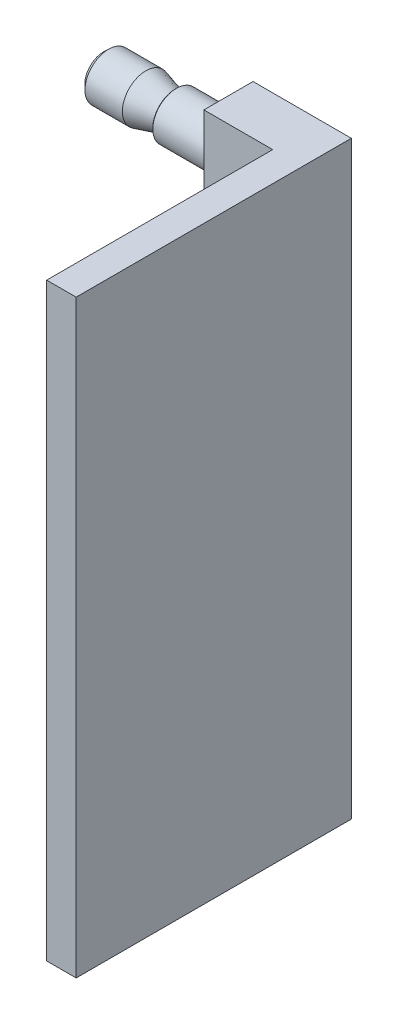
ISO-10303-21;
HEADER;
FILE_DESCRIPTION(('STEP AP214'),'2;1');
FILE_NAME('part.step','',(''),(''),'','','');
FILE_SCHEMA(('AUTOMOTIVE_DESIGN { 1 0 10303 214 1 1 1 1 }'));
ENDSEC;
DATA;
#1=APPLICATION_CONTEXT('core data for automotive mechanical design processes');
#2=APPLICATION_PROTOCOL_DEFINITION('international standard','automotive_design',2000,#1);
#3=PRODUCT_CONTEXT('',#1,'mechanical');
#4=PRODUCT('Part','Part','',(#3));
#5=PRODUCT_RELATED_PRODUCT_CATEGORY('part','',(#4));
#6=PRODUCT_DEFINITION_FORMATION('','',#4);
#7=PRODUCT_DEFINITION_CONTEXT('part definition',#1,'design');
#8=PRODUCT_DEFINITION('design','',#6,#7);
#9=PRODUCT_DEFINITION_SHAPE('','',#8);
#10=(LENGTH_UNIT() NAMED_UNIT(*) SI_UNIT(.MILLI.,.METRE.));
#11=(NAMED_UNIT(*) PLANE_ANGLE_UNIT() SI_UNIT($,.RADIAN.));
#12=(NAMED_UNIT(*) SI_UNIT($,.STERADIAN.) SOLID_ANGLE_UNIT());
#13=UNCERTAINTY_MEASURE_WITH_UNIT(LENGTH_MEASURE(1.E-05),#10,'distance_accuracy_value','');
#14=(GEOMETRIC_REPRESENTATION_CONTEXT(3) GLOBAL_UNCERTAINTY_ASSIGNED_CONTEXT((#13)) GLOBAL_UNIT_ASSIGNED_CONTEXT((#10,
#11,#12)) REPRESENTATION_CONTEXT('',''));
#15=CARTESIAN_POINT('',(0.,0.,0.));
#16=DIRECTION('',(0.,0.,1.));
#17=DIRECTION('',(1.,0.,0.));
#18=AXIS2_PLACEMENT_3D('',#15,#16,#17);
#19=CARTESIAN_POINT('',(-23.3077026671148,25.,1.90021068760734));
#20=DIRECTION('',(1.,0.,0.));
#21=DIRECTION('',(0.,1.,0.));
#22=AXIS2_PLACEMENT_3D('',#19,#20,#21);
#23=CONICAL_SURFACE('',#22,1.91884038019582,0.760039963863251);
#24=CARTESIAN_POINT('',(-20.8439243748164,21.1864694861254,0.));
#25=CARTESIAN_POINT('',(-20.9254013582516,21.2730100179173,0.));
#26=CARTESIAN_POINT('',(-21.0065991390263,21.3598157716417,0.));
#27=CARTESIAN_POINT('',(-21.1682881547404,21.5340975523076,0.));
#28=CARTESIAN_POINT('',(-21.2487793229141,21.6215736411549,0.));
#29=CARTESIAN_POINT('',(-21.4091962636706,21.7976541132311,0.));
#30=CARTESIAN_POINT('',(-21.4891187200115,21.8862615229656,0.));
#31=CARTESIAN_POINT('',(-21.6478597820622,22.0644545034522,0.));
#32=CARTESIAN_POINT('',(-21.7266784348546,22.1540400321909,0.));
#33=CARTESIAN_POINT('',(-21.8871965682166,22.3393718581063,0.));
#34=CARTESIAN_POINT('',(-21.9688171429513,22.4351866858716,0.));
#35=CARTESIAN_POINT('',(-22.1299954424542,22.6285343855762,0.));
#36=CARTESIAN_POINT('',(-22.2095532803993,22.7260671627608,0.));
#37=CARTESIAN_POINT('',(-22.365752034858,22.9232068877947,0.));
#38=CARTESIAN_POINT('',(-22.4423972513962,23.0228104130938,0.));
#39=CARTESIAN_POINT('',(-22.5917758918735,23.2248944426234,0.));
#40=CARTESIAN_POINT('',(-22.6645105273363,23.3273740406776,0.));
#41=CARTESIAN_POINT('',(-22.7835845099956,23.5052016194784,0.));
#42=CARTESIAN_POINT('',(-22.8313561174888,23.5795855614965,0.));
#43=CARTESIAN_POINT('',(-22.923184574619,23.7306697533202,0.));
#44=CARTESIAN_POINT('',(-22.9672400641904,23.80737083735,0.));
#45=CARTESIAN_POINT('',(-23.0500229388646,23.9629040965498,0.));
#46=CARTESIAN_POINT('',(-23.0887877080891,24.0417160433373,0.));
#47=CARTESIAN_POINT('',(-23.1596307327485,24.2022431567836,0.));
#48=CARTESIAN_POINT('',(-23.1917140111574,24.2839560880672,0.));
#49=CARTESIAN_POINT('',(-23.2542816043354,24.4723127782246,0.));
#50=CARTESIAN_POINT('',(-23.2821504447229,24.5798849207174,0.));
#51=CARTESIAN_POINT('',(-23.3099543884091,24.7434001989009,0.));
#52=CARTESIAN_POINT('',(-23.3168891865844,24.7981871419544,0.));
#53=CARTESIAN_POINT('',(-23.3257982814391,24.9081756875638,0.));
#54=CARTESIAN_POINT('',(-23.3277727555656,24.9633772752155,0.));
#55=CARTESIAN_POINT('',(-23.3266393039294,25.0738598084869,0.));
#56=CARTESIAN_POINT('',(-23.3235190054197,25.1291406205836,0.));
#57=CARTESIAN_POINT('',(-23.312350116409,25.2391973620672,0.));
#58=CARTESIAN_POINT('',(-23.3043012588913,25.2939732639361,0.));
#59=CARTESIAN_POINT('',(-23.2836509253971,25.4028483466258,0.));
#60=CARTESIAN_POINT('',(-23.2710335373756,25.4569444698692,0.));
#61=CARTESIAN_POINT('',(-23.2418035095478,25.564034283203,0.));
#62=CARTESIAN_POINT('',(-23.2251905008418,25.6170278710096,0.));
#63=CARTESIAN_POINT('',(-23.1677524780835,25.7813573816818,0.));
#64=CARTESIAN_POINT('',(-23.1208628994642,25.8905764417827,0.));
#65=CARTESIAN_POINT('',(-23.0165931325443,26.1038985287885,0.));
#66=CARTESIAN_POINT('',(-22.959194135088,26.2079919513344,0.));
#67=CARTESIAN_POINT('',(-22.8365194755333,26.4134252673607,0.));
#68=CARTESIAN_POINT('',(-22.7711419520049,26.514703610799,0.));
#69=CARTESIAN_POINT('',(-22.6694236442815,26.6640270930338,0.));
#70=CARTESIAN_POINT('',(-22.6349228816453,26.7133507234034,0.));
#71=CARTESIAN_POINT('',(-22.5648837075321,26.8112542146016,0.));
#72=CARTESIAN_POINT('',(-22.5293453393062,26.8598341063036,0.));
#73=CARTESIAN_POINT('',(-22.4105863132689,27.0191560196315,0.));
#74=CARTESIAN_POINT('',(-22.3255064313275,27.128511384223,0.));
#75=CARTESIAN_POINT('',(-22.1521769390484,27.3446890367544,0.));
#76=CARTESIAN_POINT('',(-22.0639267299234,27.4515108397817,0.));
#77=CARTESIAN_POINT('',(-21.8850948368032,27.6632831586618,0.));
#78=CARTESIAN_POINT('',(-21.7945118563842,27.7682325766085,0.));
#79=CARTESIAN_POINT('',(-21.6116434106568,27.9766402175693,0.));
#80=CARTESIAN_POINT('',(-21.5193578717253,28.0800983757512,0.));
#81=CARTESIAN_POINT('',(-21.2400907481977,28.3892770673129,0.));
#82=CARTESIAN_POINT('',(-21.0511745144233,28.5932478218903,0.));
#83=CARTESIAN_POINT('',(-20.6702555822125,28.9981334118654,0.));
#84=CARTESIAN_POINT('',(-20.4782539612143,29.1990492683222,0.));
#85=CARTESIAN_POINT('',(-20.1157618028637,29.5743769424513,0.));
#86=CARTESIAN_POINT('',(-19.945513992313,29.7490235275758,0.));
#87=CARTESIAN_POINT('',(-19.6038155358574,30.0971696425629,0.));
#88=CARTESIAN_POINT('',(-19.4323647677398,30.2706690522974,0.));
#89=CARTESIAN_POINT('',(-19.0894315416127,30.6159266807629,0.));
#90=CARTESIAN_POINT('',(-18.9179534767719,30.7876892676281,0.));
#91=CARTESIAN_POINT('',(-18.5743310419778,31.1305045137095,0.));
#92=CARTESIAN_POINT('',(-18.4021867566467,31.3015572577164,0.));
#93=CARTESIAN_POINT('',(-18.2297937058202,31.4723573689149,0.));
#94=B_SPLINE_CURVE_WITH_KNOTS('',3,(#24,#25,#26,#27,#28,#29,#30,#31,#32,#33,#34,#35,#36,#37,#38,
#39,#40,#41,#42,#43,#44,#45,#46,#47,#48,#49,#50,#51,#52,#53,#54,#55,#56,#57,#58,#59,#60,#61,#62,
#63,#64,#65,#66,#67,#68,#69,#70,#71,#72,#73,#74,#75,#76,#77,#78,#79,#80,#81,#82,#83,#84,#85,#86,
#87,#88,#89,#90,#91,#92,#93),.UNSPECIFIED.,.F.,.F.,(4,2,2,2,2,2,2,2,2,2,2,2,2,2,2,2,2,2,2,2,2,2,
2,2,2,2,2,2,2,2,2,2,2,2,4),(0.,0.356582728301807,0.713198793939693,1.07117165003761,
1.42912919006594,1.80670775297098,2.1842655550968,2.56124239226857,2.93810175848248,
3.20322959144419,3.46845404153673,3.7316949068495,3.99473715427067,4.32661386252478,
4.49209272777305,4.6575656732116,4.82344107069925,4.989325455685,5.15579325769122,
5.32227643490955,5.67789990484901,6.03416618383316,6.39558215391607,6.57615089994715,
6.75671212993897,7.1722768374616,7.58792045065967,8.00380026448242,8.41969810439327,
9.25368397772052,10.0873846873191,10.8190678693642,11.5508264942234,12.2789479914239,
13.006979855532),.UNSPECIFIED.);
#95=CARTESIAN_POINT('',(-22.8013790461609,23.5337970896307,0.));
#96=VERTEX_POINT('',#95);
#97=CARTESIAN_POINT('',(-23.3077026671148,24.7332646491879,0.));
#98=VERTEX_POINT('',#97);
#99=EDGE_CURVE('E43',#96,#98,#94,.T.);
#100=ORIENTED_EDGE('',*,*,#99,.F.);
#101=CARTESIAN_POINT('',(-22.8013790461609,25.,1.90021068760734));
#102=DIRECTION('',(1.,0.,0.));
#103=DIRECTION('',(0.,1.,0.));
#104=AXIS2_PLACEMENT_3D('',#101,#102,#103);
#105=CIRCLE('',#104,2.40011492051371);
#106=CARTESIAN_POINT('',(-22.8013790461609,26.4662029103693,0.));
#107=VERTEX_POINT('',#106);
#108=EDGE_CURVE('E281',#107,#96,#105,.T.);
#109=ORIENTED_EDGE('',*,*,#108,.F.);
#110=CARTESIAN_POINT('',(-23.3077026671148,25.2667353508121,0.));
#111=VERTEX_POINT('',#110);
#112=EDGE_CURVE('E467',#111,#107,#94,.T.);
#113=ORIENTED_EDGE('',*,*,#112,.F.);
#114=CARTESIAN_POINT('',(-23.3077026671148,25.,1.90021068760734));
#115=DIRECTION('',(1.,0.,0.));
#116=DIRECTION('',(0.,1.,0.));
#117=AXIS2_PLACEMENT_3D('',#114,#115,#116);
#118=CIRCLE('',#117,1.91884038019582);
#119=EDGE_CURVE('E238',#111,#98,#118,.T.);
#120=ORIENTED_EDGE('',*,*,#119,.T.);
#121=EDGE_LOOP('',(#100,#109,#113,#120));
#122=FACE_BOUND('',#121,.T.);
#123=ADVANCED_FACE('F14',(#122),#23,.T.);
#124=CARTESIAN_POINT('',(-10.0009576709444,25.,1.90021068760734));
#125=DIRECTION('',(1.,0.,0.));
#126=DIRECTION('',(0.,1.,0.));
#127=AXIS2_PLACEMENT_3D('',#124,#125,#126);
#128=CYLINDRICAL_SURFACE('',#127,2.40011492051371);
#129=DIRECTION('',(1.,0.,0.));
#130=VECTOR('',#129,1.);
#131=CARTESIAN_POINT('',(-10.0009576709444,26.4662029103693,0.));
#132=LINE('',#131,#130);
#133=CARTESIAN_POINT('',(-19.0015322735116,26.4662029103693,0.));
#134=VERTEX_POINT('',#133);
#135=EDGE_CURVE('E887',#107,#134,#132,.T.);
#136=ORIENTED_EDGE('',*,*,#135,.F.);
#137=ORIENTED_EDGE('',*,*,#108,.T.);
#138=DIRECTION('',(1.,0.,0.));
#139=VECTOR('',#138,1.);
#140=CARTESIAN_POINT('',(-10.0009576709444,23.5337970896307,0.));
#141=LINE('',#140,#139);
#142=CARTESIAN_POINT('',(-19.0015322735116,23.5337970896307,0.));
#143=VERTEX_POINT('',#142);
#144=EDGE_CURVE('E890',#143,#96,#141,.F.);
#145=ORIENTED_EDGE('',*,*,#144,.F.);
#146=CARTESIAN_POINT('',(-19.0015322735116,25.,1.90021068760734));
#147=DIRECTION('',(1.,0.,0.));
#148=DIRECTION('',(0.,1.,0.));
#149=AXIS2_PLACEMENT_3D('',#146,#147,#148);
#150=CIRCLE('',#149,2.40011492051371);
#151=EDGE_CURVE('E278',#134,#143,#150,.T.);
#152=ORIENTED_EDGE('',*,*,#151,.F.);
#153=EDGE_LOOP('',(#136,#137,#145,#152));
#154=FACE_BOUND('',#153,.T.);
#155=ADVANCED_FACE('F515',(#154),#128,.T.);
#156=CARTESIAN_POINT('',(-19.0015322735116,25.,1.90021068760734));
#157=DIRECTION('',(-1.,0.,0.));
#158=DIRECTION('',(0.,-1.,0.));
#159=AXIS2_PLACEMENT_3D('',#156,#157,#158);
#160=CONICAL_SURFACE('',#159,2.40011492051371,0.261760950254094);
#161=CARTESIAN_POINT('',(-16.3784715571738,25.,1.90021068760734));
#162=DIRECTION('',(1.,0.,0.));
#163=DIRECTION('',(0.,1.,0.));
#164=AXIS2_PLACEMENT_3D('',#161,#162,#163);
#165=CIRCLE('',#164,1.69737598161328);
#166=CARTESIAN_POINT('',(-16.3784715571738,26.6973759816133,1.90021068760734));
#167=VERTEX_POINT('',#166);
#168=EDGE_CURVE('E275',#167,#167,#165,.T.);
#169=ORIENTED_EDGE('',*,*,#168,.F.);
#170=EDGE_LOOP('',(#169));
#171=FACE_BOUND('',#170,.T.);
#172=CARTESIAN_POINT('',(-21.9498762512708,22.4377161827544,0.));
#173=CARTESIAN_POINT('',(-21.8062573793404,22.4856277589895,0.));
#174=CARTESIAN_POINT('',(-21.6627751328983,22.5339535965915,0.));
#175=CARTESIAN_POINT('',(-21.3761477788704,22.6316250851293,0.));
#176=CARTESIAN_POINT('',(-21.2330026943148,22.6809708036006,0.));
#177=CARTESIAN_POINT('',(-20.9467982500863,22.7809838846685,0.));
#178=CARTESIAN_POINT('',(-20.803739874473,22.8316540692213,0.));
#179=CARTESIAN_POINT('',(-20.5181567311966,22.934465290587,0.));
#180=CARTESIAN_POINT('',(-20.3756319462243,22.9866062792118,0.));
#181=CARTESIAN_POINT('',(-20.0913111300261,23.0926896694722,0.));
#182=CARTESIAN_POINT('',(-19.9495148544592,23.1466314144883,0.));
#183=CARTESIAN_POINT('',(-19.666819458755,23.2568144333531,0.));
#184=CARTESIAN_POINT('',(-19.525920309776,23.3130556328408,0.));
#185=CARTESIAN_POINT('',(-19.2454807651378,23.4284834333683,0.));
#186=CARTESIAN_POINT('',(-19.105939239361,23.487667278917,0.));
#187=CARTESIAN_POINT('',(-18.8286407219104,23.6100585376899,0.));
#188=CARTESIAN_POINT('',(-18.6908833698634,23.6732651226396,0.));
#189=CARTESIAN_POINT('',(-18.5028690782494,23.7643878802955,0.));
#190=CARTESIAN_POINT('',(-18.4514168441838,23.7898352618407,0.));
#191=CARTESIAN_POINT('',(-18.3490065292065,23.8417108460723,0.));
#192=CARTESIAN_POINT('',(-18.2980484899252,23.8681391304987,0.));
#193=CARTESIAN_POINT('',(-18.1457640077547,23.9492876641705,0.));
#194=CARTESIAN_POINT('',(-18.0453268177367,24.0057287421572,0.));
#195=CARTESIAN_POINT('',(-17.8979844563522,24.0951935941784,0.));
#196=CARTESIAN_POINT('',(-17.8495623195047,24.1257174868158,0.));
#197=CARTESIAN_POINT('',(-17.7540768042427,24.1888121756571,0.));
#198=CARTESIAN_POINT('',(-17.7070130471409,24.2213823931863,0.));
#199=CARTESIAN_POINT('',(-17.6149422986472,24.2889782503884,0.));
#200=CARTESIAN_POINT('',(-17.5699281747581,24.3239940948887,0.));
#201=CARTESIAN_POINT('',(-17.4826710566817,24.3972933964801,0.));
#202=CARTESIAN_POINT('',(-17.4404248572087,24.4355729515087,0.));
#203=CARTESIAN_POINT('',(-17.3716198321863,24.5049212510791,0.));
#204=CARTESIAN_POINT('',(-17.3440170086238,24.5349437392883,0.));
#205=CARTESIAN_POINT('',(-17.2918987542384,24.5976912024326,0.));
#206=CARTESIAN_POINT('',(-17.267388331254,24.6304204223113,0.));
#207=CARTESIAN_POINT('',(-17.2226371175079,24.6994074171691,0.));
#208=CARTESIAN_POINT('',(-17.2024603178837,24.7357078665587,0.));
#209=CARTESIAN_POINT('',(-17.1690802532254,24.8113664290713,0.));
#210=CARTESIAN_POINT('',(-17.1558486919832,24.8507113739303,0.));
#211=CARTESIAN_POINT('',(-17.1410774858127,24.9198153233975,0.));
#212=CARTESIAN_POINT('',(-17.1372728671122,24.9490870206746,0.));
#213=CARTESIAN_POINT('',(-17.134792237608,25.0078574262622,0.));
#214=CARTESIAN_POINT('',(-17.1361158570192,25.0373561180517,0.));
#215=CARTESIAN_POINT('',(-17.1437164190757,25.0955935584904,0.));
#216=CARTESIAN_POINT('',(-17.149977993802,25.1243343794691,0.));
#217=CARTESIAN_POINT('',(-17.1667447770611,25.1805268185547,0.));
#218=CARTESIAN_POINT('',(-17.1772522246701,25.207977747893,0.));
#219=CARTESIAN_POINT('',(-17.2094963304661,25.2784775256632,0.));
#220=CARTESIAN_POINT('',(-17.2341080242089,25.3201972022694,0.));
#221=CARTESIAN_POINT('',(-17.2892193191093,25.3995735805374,0.));
#222=CARTESIAN_POINT('',(-17.3197421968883,25.4372132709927,0.));
#223=CARTESIAN_POINT('',(-17.396476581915,25.5223080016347,0.));
#224=CARTESIAN_POINT('',(-17.4443232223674,25.5682652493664,0.));
#225=CARTESIAN_POINT('',(-17.5441500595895,25.6555100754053,0.));
#226=CARTESIAN_POINT('',(-17.5961392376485,25.6967870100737,0.));
#227=CARTESIAN_POINT('',(-17.7033755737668,25.7762983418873,0.));
#228=CARTESIAN_POINT('',(-17.7586552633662,25.8144884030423,0.));
#229=CARTESIAN_POINT('',(-17.8709386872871,25.8880613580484,0.));
#230=CARTESIAN_POINT('',(-17.9279403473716,25.9234474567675,0.));
#231=CARTESIAN_POINT('',(-18.0530263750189,25.9979044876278,0.));
#232=CARTESIAN_POINT('',(-18.1213461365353,26.0365778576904,0.));
#233=CARTESIAN_POINT('',(-18.2592331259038,26.1116425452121,0.));
#234=CARTESIAN_POINT('',(-18.3288005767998,26.1480334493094,0.));
#235=CARTESIAN_POINT('',(-18.5389578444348,26.2545488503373,0.));
#236=CARTESIAN_POINT('',(-18.680916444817,26.321966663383,0.));
#237=CARTESIAN_POINT('',(-18.9675191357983,26.4521837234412,0.));
#238=CARTESIAN_POINT('',(-19.1121711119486,26.5149652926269,0.));
#239=CARTESIAN_POINT('',(-19.4028969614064,26.6369726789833,0.));
#240=CARTESIAN_POINT('',(-19.548970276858,26.6961998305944,0.));
#241=CARTESIAN_POINT('',(-19.8250286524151,26.805232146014,0.));
#242=CARTESIAN_POINT('',(-19.9548990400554,26.8553295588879,0.));
#243=CARTESIAN_POINT('',(-20.2152820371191,26.9538693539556,0.));
#244=CARTESIAN_POINT('',(-20.3457947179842,27.0023115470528,0.));
#245=CARTESIAN_POINT('',(-20.6063787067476,27.0975020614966,0.));
#246=CARTESIAN_POINT('',(-20.7364465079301,27.1442600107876,0.));
#247=CARTESIAN_POINT('',(-20.9969575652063,27.2366487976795,0.));
#248=CARTESIAN_POINT('',(-21.1274007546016,27.2822798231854,0.));
#249=CARTESIAN_POINT('',(-21.2579983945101,27.3274583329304,0.));
#250=B_SPLINE_CURVE_WITH_KNOTS('',3,(#172,#173,#174,#175,#176,#177,#178,#179,#180,#181,#182,
#183,#184,#185,#186,#187,#188,#189,#190,#191,#192,#193,#194,#195,#196,#197,#198,#199,#200,#201,
#202,#203,#204,#205,#206,#207,#208,#209,#210,#211,#212,#213,#214,#215,#216,#217,#218,#219,#220,
#221,#222,#223,#224,#225,#226,#227,#228,#229,#230,#231,#232,#233,#234,#235,#236,#237,#238,#239,
#240,#241,#242,#243,#244,#245,#246,#247,#248,#249),.UNSPECIFIED.,.F.,.F.,(4,2,2,2,2,2,2,2,2,2,2,
2,2,2,2,2,2,2,2,2,2,2,2,2,2,2,2,2,2,2,2,2,2,2,2,2,2,2,4),(0.,0.454201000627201,
0.908432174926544,1.36372604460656,1.81900501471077,2.2741197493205,2.72921977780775,
3.1839013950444,3.63848969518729,3.8106831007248,3.98289088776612,4.328301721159,
4.49998452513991,4.67161899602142,4.84260162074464,5.01338261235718,5.13558373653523,
5.25798028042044,5.38207585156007,5.50566183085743,5.59380081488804,5.68193344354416,
5.7697928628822,5.85769867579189,6.00216838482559,6.14721898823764,6.34574962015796,
6.54472304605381,6.7461765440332,6.9473963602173,7.18285547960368,7.41835711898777,
7.88965781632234,8.36267155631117,8.83550658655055,9.25308792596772,9.67071681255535,
10.0853624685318,10.4999385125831),.UNSPECIFIED.);
#251=EDGE_CURVE('E366',#134,#143,#250,.F.);
#252=ORIENTED_EDGE('',*,*,#251,.F.);
#253=ORIENTED_EDGE('',*,*,#151,.T.);
#254=EDGE_LOOP('',(#252,#253));
#255=FACE_BOUND('',#254,.T.);
#256=ADVANCED_FACE('F521',(#171,#255),#160,.T.);
#257=CARTESIAN_POINT('',(-16.0245522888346,25.,1.90021068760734));
#258=DIRECTION('',(1.,0.,0.));
#259=DIRECTION('',(0.,1.,0.));
#260=AXIS2_PLACEMENT_3D('',#257,#258,#259);
#261=CONICAL_SURFACE('',#260,1.87029544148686,1.37127084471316);
#262=CARTESIAN_POINT('',(-16.0245522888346,25.,1.90021068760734));
#263=DIRECTION('',(1.,0.,0.));
#264=DIRECTION('',(0.,1.,0.));
#265=AXIS2_PLACEMENT_3D('',#262,#263,#264);
#266=CIRCLE('',#265,1.87029544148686);
#267=CARTESIAN_POINT('',(-16.0245522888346,26.8702954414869,1.90021068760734));
#268=VERTEX_POINT('',#267);
#269=EDGE_CURVE('E263',#268,#268,#266,.T.);
#270=ORIENTED_EDGE('',*,*,#269,.T.);
#271=EDGE_LOOP('',(#270));
#272=FACE_BOUND('',#271,.T.);
#273=CARTESIAN_POINT('',(-15.7201397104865,22.2099457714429,0.));
#274=CARTESIAN_POINT('',(-15.7343595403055,22.2950400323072,0.));
#275=CARTESIAN_POINT('',(-15.7483839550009,22.3801669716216,0.));
#276=CARTESIAN_POINT('',(-15.7759443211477,22.5505023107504,0.));
#277=CARTESIAN_POINT('',(-15.7894802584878,22.6357107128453,0.));
#278=CARTESIAN_POINT('',(-15.8292311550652,22.8916260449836,0.));
#279=CARTESIAN_POINT('',(-15.8545636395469,23.0624722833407,0.));
#280=CARTESIAN_POINT('',(-15.9015214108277,23.4035377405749,0.));
#281=CARTESIAN_POINT('',(-15.923170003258,23.5737536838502,0.));
#282=CARTESIAN_POINT('',(-15.9611839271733,23.9147313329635,0.));
#283=CARTESIAN_POINT('',(-15.9775511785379,24.0854928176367,0.));
#284=CARTESIAN_POINT('',(-16.0027913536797,24.4284508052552,0.));
#285=CARTESIAN_POINT('',(-16.0116272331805,24.600650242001,0.));
#286=CARTESIAN_POINT('',(-16.0178415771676,24.8591291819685,0.));
#287=CARTESIAN_POINT('',(-16.0187394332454,24.9453301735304,0.));
#288=CARTESIAN_POINT('',(-16.0181606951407,25.1177225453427,0.));
#289=CARTESIAN_POINT('',(-16.0166841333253,25.2039139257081,0.));
#290=CARTESIAN_POINT('',(-16.0087556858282,25.4634017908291,0.));
#291=CARTESIAN_POINT('',(-15.9987814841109,25.6365982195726,0.));
#292=CARTESIAN_POINT('',(-15.9782444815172,25.895920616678,0.));
#293=CARTESIAN_POINT('',(-15.9704685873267,25.9822903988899,0.));
#294=CARTESIAN_POINT('',(-15.9533580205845,26.1548597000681,0.));
#295=CARTESIAN_POINT('',(-15.9440236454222,26.2410592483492,0.));
#296=CARTESIAN_POINT('',(-15.9340584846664,26.3271863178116,0.));
#297=B_SPLINE_CURVE_WITH_KNOTS('',3,(#273,#274,#275,#276,#277,#278,#279,#280,#281,#282,#283,
#284,#285,#286,#287,#288,#289,#290,#291,#292,#293,#294,#295,#296),.UNSPECIFIED.,.F.,.F.,(4,2,2,
2,2,2,2,2,2,2,2,4),(0.,0.258822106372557,0.517651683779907,1.0357697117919,1.55047712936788,
2.06499722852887,2.5820337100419,2.84062016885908,3.09920310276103,3.61940692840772,
3.87955530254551,4.13965409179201),.UNSPECIFIED.);
#298=CARTESIAN_POINT('',(-16.0009576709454,24.4192490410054,0.));
#299=VERTEX_POINT('',#298);
#300=CARTESIAN_POINT('',(-16.0009576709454,25.5807509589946,0.));
#301=VERTEX_POINT('',#300);
#302=EDGE_CURVE('E383',#299,#301,#297,.T.);
#303=ORIENTED_EDGE('',*,*,#302,.F.);
#304=CARTESIAN_POINT('',(-16.0009576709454,25.,1.90021068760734));
#305=DIRECTION('',(1.,0.,0.));
#306=DIRECTION('',(0.,1.,0.));
#307=AXIS2_PLACEMENT_3D('',#304,#305,#306);
#308=CIRCLE('',#307,1.98697567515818);
#309=EDGE_CURVE('E260',#301,#299,#308,.T.);
#310=ORIENTED_EDGE('',*,*,#309,.F.);
#311=EDGE_LOOP('',(#303,#310));
#312=FACE_BOUND('',#311,.T.);
#313=ADVANCED_FACE('F504',(#272,#312),#261,.T.);
#314=CARTESIAN_POINT('',(-16.0009576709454,25.,3.88718636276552));
#315=DIRECTION('',(1.,0.,0.));
#316=DIRECTION('',(0.,1.,0.));
#317=AXIS2_PLACEMENT_3D('',#314,#315,#316);
#318=PLANE('',#317);
#319=DIRECTION('',(0.,1.,0.));
#320=VECTOR('',#319,1.);
#321=CARTESIAN_POINT('',(-16.0009576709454,25.,0.));
#322=LINE('',#321,#320);
#323=CARTESIAN_POINT('',(-16.0009576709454,23.703922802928,0.));
#324=VERTEX_POINT('',#323);
#325=EDGE_CURVE('E375',#324,#299,#322,.T.);
#326=ORIENTED_EDGE('',*,*,#325,.F.);
#327=CARTESIAN_POINT('',(-16.0009576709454,25.,1.90021068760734));
#328=DIRECTION('',(1.,0.,0.));
#329=DIRECTION('',(0.,1.,0.));
#330=AXIS2_PLACEMENT_3D('',#327,#328,#329);
#331=CIRCLE('',#330,2.30013407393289);
#332=CARTESIAN_POINT('',(-16.0009576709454,26.296077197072,0.));
#333=VERTEX_POINT('',#332);
#334=EDGE_CURVE('E257',#333,#324,#331,.T.);
#335=ORIENTED_EDGE('',*,*,#334,.F.);
#336=EDGE_CURVE('E495',#301,#333,#322,.T.);
#337=ORIENTED_EDGE('',*,*,#336,.F.);
#338=ORIENTED_EDGE('',*,*,#309,.T.);
#339=EDGE_LOOP('',(#326,#335,#337,#338));
#340=FACE_BOUND('',#339,.T.);
#341=ADVANCED_FACE('F505',(#340),#318,.F.);
#342=CARTESIAN_POINT('',(-16.0009576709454,25.,1.90021068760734));
#343=DIRECTION('',(1.,0.,0.));
#344=DIRECTION('',(0.,1.,0.));
#345=AXIS2_PLACEMENT_3D('',#342,#343,#344);
#346=CONICAL_SURFACE('',#345,2.30013407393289,0.785398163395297);
#347=CARTESIAN_POINT('',(-13.8849515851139,21.0135864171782,0.));
#348=CARTESIAN_POINT('',(-13.9688770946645,21.1065728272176,0.));
#349=CARTESIAN_POINT('',(-14.0525174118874,21.1998189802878,0.));
#350=CARTESIAN_POINT('',(-14.2190693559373,21.3869739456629,0.));
#351=CARTESIAN_POINT('',(-14.3019809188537,21.4808828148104,0.));
#352=CARTESIAN_POINT('',(-14.4671066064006,21.6697238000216,0.));
#353=CARTESIAN_POINT('',(-14.5493184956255,21.7646578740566,0.));
#354=CARTESIAN_POINT('',(-14.7125943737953,21.9555037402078,0.));
#355=CARTESIAN_POINT('',(-14.793658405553,22.0514154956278,0.));
#356=CARTESIAN_POINT('',(-14.9528778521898,22.2427368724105,0.));
#357=CARTESIAN_POINT('',(-15.0310593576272,22.3381247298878,0.));
#358=CARTESIAN_POINT('',(-15.1855668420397,22.5303901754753,0.));
#359=CARTESIAN_POINT('',(-15.2618929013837,22.6272676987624,0.));
#360=CARTESIAN_POINT('',(-15.4120226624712,22.822879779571,0.));
#361=CARTESIAN_POINT('',(-15.4858277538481,22.9216132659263,0.));
#362=CARTESIAN_POINT('',(-15.6300199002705,23.1215346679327,0.));
#363=CARTESIAN_POINT('',(-15.7004076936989,23.2227220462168,0.));
#364=CARTESIAN_POINT('',(-15.8228419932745,23.4079152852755,0.));
#365=CARTESIAN_POINT('',(-15.8757555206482,23.4913439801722,0.));
#366=CARTESIAN_POINT('',(-15.9772989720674,23.6606701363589,0.));
#367=CARTESIAN_POINT('',(-16.0259333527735,23.746564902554,0.));
#368=CARTESIAN_POINT('',(-16.1177163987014,23.9220576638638,0.));
#369=CARTESIAN_POINT('',(-16.1608251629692,24.0116770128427,0.));
#370=CARTESIAN_POINT('',(-16.2193958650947,24.1489010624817,0.));
#371=CARTESIAN_POINT('',(-16.237931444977,24.1951928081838,0.));
#372=CARTESIAN_POINT('',(-16.2725833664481,24.2887102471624,0.));
#373=CARTESIAN_POINT('',(-16.2886978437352,24.3359366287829,0.));
#374=CARTESIAN_POINT('',(-16.3034118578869,24.3836200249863,0.));
#375=B_SPLINE_CURVE_WITH_KNOTS('',3,(#347,#348,#349,#350,#351,#352,#353,#354,#355,#356,#357,
#358,#359,#360,#361,#362,#363,#364,#365,#366,#367,#368,#369,#370,#371,#372,#373,#374),
.UNSPECIFIED.,.F.,.F.,(4,2,2,2,2,2,2,2,2,2,2,2,2,4),(0.,0.375780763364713,0.75159415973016,
1.12833815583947,1.50506806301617,1.87505180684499,2.24501949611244,2.61477984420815,
2.98445993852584,3.28074749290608,3.57672272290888,3.8747273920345,4.02426084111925,
4.17390885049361),.UNSPECIFIED.);
#376=CARTESIAN_POINT('',(-15.900976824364,23.5337970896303,0.));
#377=VERTEX_POINT('',#376);
#378=EDGE_CURVE('E374',#377,#324,#375,.T.);
#379=ORIENTED_EDGE('',*,*,#378,.F.);
#380=CARTESIAN_POINT('',(-15.9009768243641,25.,1.90021068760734));
#381=DIRECTION('',(1.,0.,0.));
#382=DIRECTION('',(0.,1.,0.));
#383=AXIS2_PLACEMENT_3D('',#380,#381,#382);
#384=CIRCLE('',#383,2.40011492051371);
#385=CARTESIAN_POINT('',(-15.9009768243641,26.4662029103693,0.));
#386=VERTEX_POINT('',#385);
#387=EDGE_CURVE('E254',#386,#377,#384,.T.);
#388=ORIENTED_EDGE('',*,*,#387,.F.);
#389=CARTESIAN_POINT('',(-16.3034118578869,25.6163799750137,0.));
#390=CARTESIAN_POINT('',(-16.2886978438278,25.6640633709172,0.));
#391=CARTESIAN_POINT('',(-16.2725833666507,25.7112897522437,0.));
#392=CARTESIAN_POINT('',(-16.2379314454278,25.8048071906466,0.));
#393=CARTESIAN_POINT('',(-16.2193958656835,25.8510989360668,0.));
#394=CARTESIAN_POINT('',(-16.1608251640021,25.9883229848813,0.));
#395=CARTESIAN_POINT('',(-16.1177164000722,26.0779423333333,0.));
#396=CARTESIAN_POINT('',(-16.0259333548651,26.2534350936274,0.));
#397=CARTESIAN_POINT('',(-15.9772989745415,26.3393298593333,0.));
#398=CARTESIAN_POINT('',(-15.8757555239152,26.5086560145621,0.));
#399=CARTESIAN_POINT('',(-15.8228419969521,26.5920847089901,0.));
#400=CARTESIAN_POINT('',(-15.7004076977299,26.7772779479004,0.));
#401=CARTESIAN_POINT('',(-15.6300199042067,26.8784653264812,0.));
#402=CARTESIAN_POINT('',(-15.4858277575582,27.078386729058,0.));
#403=CARTESIAN_POINT('',(-15.4120226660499,27.177120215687,0.));
#404=CARTESIAN_POINT('',(-15.2618929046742,27.3727322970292,0.));
#405=CARTESIAN_POINT('',(-15.1855668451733,27.4696098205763,0.));
#406=CARTESIAN_POINT('',(-15.0310593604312,27.6618752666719,0.));
#407=CARTESIAN_POINT('',(-14.9528778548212,27.7572631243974,0.));
#408=CARTESIAN_POINT('',(-14.7936584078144,27.9485845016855,0.));
#409=CARTESIAN_POINT('',(-14.712594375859,28.0444962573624,0.));
#410=CARTESIAN_POINT('',(-14.5493184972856,28.2353421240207,0.));
#411=CARTESIAN_POINT('',(-14.4671066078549,28.330276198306,0.));
#412=CARTESIAN_POINT('',(-14.3019809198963,28.5191171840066,0.));
#413=CARTESIAN_POINT('',(-14.219069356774,28.6130260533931,0.));
#414=CARTESIAN_POINT('',(-14.0525174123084,28.8001810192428,0.));
#415=CARTESIAN_POINT('',(-13.9688770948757,28.8934271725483,0.));
#416=CARTESIAN_POINT('',(-13.8849515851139,28.9864135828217,0.));
#417=B_SPLINE_CURVE_WITH_KNOTS('',3,(#389,#390,#391,#392,#393,#394,#395,#396,#397,#398,#399,
#400,#401,#402,#403,#404,#405,#406,#407,#408,#409,#410,#411,#412,#413,#414,#415,#416),
.UNSPECIFIED.,.F.,.F.,(4,2,2,2,2,2,2,2,2,2,2,2,2,4),(0.,0.149648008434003,0.299181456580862,
0.597186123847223,0.893161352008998,1.18944890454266,1.55912899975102,1.92888934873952,
2.29885703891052,2.66884078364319,3.04557069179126,3.42231468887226,3.79812808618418,
4.1739088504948),.UNSPECIFIED.);
#418=EDGE_CURVE('E490',#333,#386,#417,.T.);
#419=ORIENTED_EDGE('',*,*,#418,.F.);
#420=ORIENTED_EDGE('',*,*,#334,.T.);
#421=EDGE_LOOP('',(#379,#388,#419,#420));
#422=FACE_BOUND('',#421,.T.);
#423=ADVANCED_FACE('F390',(#422),#346,.T.);
#424=CARTESIAN_POINT('',(-10.0009576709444,25.,1.90021068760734));
#425=DIRECTION('',(1.,0.,0.));
#426=DIRECTION('',(0.,1.,0.));
#427=AXIS2_PLACEMENT_3D('',#424,#425,#426);
#428=CYLINDRICAL_SURFACE('',#427,2.40011492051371);
#429=DIRECTION('',(1.,0.,0.));
#430=VECTOR('',#429,1.);
#431=CARTESIAN_POINT('',(-10.0009576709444,26.4662029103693,0.));
#432=LINE('',#431,#430);
#433=CARTESIAN_POINT('',(-10.1009385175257,26.4662029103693,0.));
#434=VERTEX_POINT('',#433);
#435=EDGE_CURVE('E35',#386,#434,#432,.T.);
#436=ORIENTED_EDGE('',*,*,#435,.F.);
#437=ORIENTED_EDGE('',*,*,#387,.T.);
#438=DIRECTION('',(1.,0.,0.));
#439=VECTOR('',#438,1.);
#440=CARTESIAN_POINT('',(-10.0009576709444,23.5337970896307,0.));
#441=LINE('',#440,#439);
#442=CARTESIAN_POINT('',(-10.1009385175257,23.5337970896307,0.));
#443=VERTEX_POINT('',#442);
#444=EDGE_CURVE('E196',#443,#377,#441,.F.);
#445=ORIENTED_EDGE('',*,*,#444,.F.);
#446=CARTESIAN_POINT('',(-10.1009385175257,25.,1.90021068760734));
#447=DIRECTION('',(1.,0.,0.));
#448=DIRECTION('',(0.,1.,0.));
#449=AXIS2_PLACEMENT_3D('',#446,#447,#448);
#450=CIRCLE('',#449,2.40011492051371);
#451=EDGE_CURVE('E247',#434,#443,#450,.T.);
#452=ORIENTED_EDGE('',*,*,#451,.F.);
#453=EDGE_LOOP('',(#436,#437,#445,#452));
#454=FACE_BOUND('',#453,.T.);
#455=ADVANCED_FACE('F372',(#454),#428,.T.);
#456=CARTESIAN_POINT('',(-10.1009385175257,25.,1.90021068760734));
#457=DIRECTION('',(-1.,0.,0.));
#458=DIRECTION('',(0.,-1.,0.));
#459=AXIS2_PLACEMENT_3D('',#456,#457,#458);
#460=CONICAL_SURFACE('',#459,2.40011492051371,0.785398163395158);
#461=CARTESIAN_POINT('',(-9.6985034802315,24.3836200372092,0.));
#462=CARTESIAN_POINT('',(-9.71321749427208,24.3359366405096,0.));
#463=CARTESIAN_POINT('',(-9.72933197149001,24.2887102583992,0.));
#464=CARTESIAN_POINT('',(-9.76398389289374,24.1951928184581,0.));
#465=CARTESIAN_POINT('',(-9.78251947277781,24.1489010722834,0.));
#466=CARTESIAN_POINT('',(-9.84109017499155,24.0116770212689,0.));
#467=CARTESIAN_POINT('',(-9.88419893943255,23.9220576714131,0.));
#468=CARTESIAN_POINT('',(-9.97598198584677,23.7465649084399,0.));
#469=CARTESIAN_POINT('',(-10.024616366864,23.6606701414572,0.));
#470=CARTESIAN_POINT('',(-10.1261598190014,23.4913439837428,0.));
#471=CARTESIAN_POINT('',(-10.1790733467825,23.4079152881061,0.));
#472=CARTESIAN_POINT('',(-10.3015076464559,23.2227220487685,0.));
#473=CARTESIAN_POINT('',(-10.3718954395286,23.1215346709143,0.));
#474=CARTESIAN_POINT('',(-10.5160875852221,22.9216132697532,0.));
#475=CARTESIAN_POINT('',(-10.589892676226,22.8228797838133,0.));
#476=CARTESIAN_POINT('',(-10.7400224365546,22.6272677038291,0.));
#477=CARTESIAN_POINT('',(-10.8163484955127,22.5303901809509,0.));
#478=CARTESIAN_POINT('',(-10.9708559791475,22.3381247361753,0.));
#479=CARTESIAN_POINT('',(-11.049037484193,22.2427368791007,0.));
#480=CARTESIAN_POINT('',(-11.2082569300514,22.0514155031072,0.));
#481=CARTESIAN_POINT('',(-11.2893209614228,21.9555037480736,0.));
#482=CARTESIAN_POINT('',(-11.4525968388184,21.7646578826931,0.));
#483=CARTESIAN_POINT('',(-11.5348087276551,21.6697238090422,0.));
#484=CARTESIAN_POINT('',(-11.6999344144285,21.4808828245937,0.));
#485=CARTESIAN_POINT('',(-11.7828459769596,21.3869739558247,0.));
#486=CARTESIAN_POINT('',(-11.9493979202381,21.1998189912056,0.));
#487=CARTESIAN_POINT('',(-12.0330382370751,21.1065728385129,0.));
#488=CARTESIAN_POINT('',(-12.1169637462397,21.0135864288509,0.));
#489=B_SPLINE_CURVE_WITH_KNOTS('',3,(#461,#462,#463,#464,#465,#466,#467,#468,#469,#470,#471,
#472,#473,#474,#475,#476,#477,#478,#479,#480,#481,#482,#483,#484,#485,#486,#487,#488),
.UNSPECIFIED.,.F.,.F.,(4,2,2,2,2,2,2,2,2,2,2,2,2,4),(0.,0.149648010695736,0.299181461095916,
0.597186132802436,0.893161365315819,1.18944892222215,1.55912901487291,1.92888936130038,
2.29885704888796,2.66884079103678,3.04557069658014,3.42231469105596,3.79812808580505,
4.17390884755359),.UNSPECIFIED.);
#490=CARTESIAN_POINT('',(-10.0009576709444,23.703922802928,0.));
#491=VERTEX_POINT('',#490);
#492=EDGE_CURVE('E191',#491,#443,#489,.T.);
#493=ORIENTED_EDGE('',*,*,#492,.F.);
#494=CARTESIAN_POINT('',(-10.0009576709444,25.,1.90021068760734));
#495=DIRECTION('',(1.,0.,0.));
#496=DIRECTION('',(0.,1.,0.));
#497=AXIS2_PLACEMENT_3D('',#494,#495,#496);
#498=CIRCLE('',#497,2.30013407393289);
#499=CARTESIAN_POINT('',(-10.0009576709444,26.296077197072,0.));
#500=VERTEX_POINT('',#499);
#501=EDGE_CURVE('E248',#500,#491,#498,.T.);
#502=ORIENTED_EDGE('',*,*,#501,.F.);
#503=CARTESIAN_POINT('',(-12.1169637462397,28.9864135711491,0.));
#504=CARTESIAN_POINT('',(-12.0330382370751,28.8934271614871,0.));
#505=CARTESIAN_POINT('',(-11.9493979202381,28.8001810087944,0.));
#506=CARTESIAN_POINT('',(-11.7828459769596,28.6130260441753,0.));
#507=CARTESIAN_POINT('',(-11.6999344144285,28.5191171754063,0.));
#508=CARTESIAN_POINT('',(-11.5348087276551,28.3302761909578,0.));
#509=CARTESIAN_POINT('',(-11.4525968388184,28.2353421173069,0.));
#510=CARTESIAN_POINT('',(-11.2893209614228,28.0444962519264,0.));
#511=CARTESIAN_POINT('',(-11.2082569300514,27.9485844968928,0.));
#512=CARTESIAN_POINT('',(-11.049037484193,27.7572631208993,0.));
#513=CARTESIAN_POINT('',(-10.9708559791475,27.6618752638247,0.));
#514=CARTESIAN_POINT('',(-10.8163484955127,27.4696098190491,0.));
#515=CARTESIAN_POINT('',(-10.7400224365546,27.3727322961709,0.));
#516=CARTESIAN_POINT('',(-10.589892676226,27.1771202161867,0.));
#517=CARTESIAN_POINT('',(-10.5160875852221,27.0783867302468,0.));
#518=CARTESIAN_POINT('',(-10.3718954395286,26.8784653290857,0.));
#519=CARTESIAN_POINT('',(-10.3015076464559,26.7772779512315,0.));
#520=CARTESIAN_POINT('',(-10.1790733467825,26.5920847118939,0.));
#521=CARTESIAN_POINT('',(-10.1261598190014,26.5086560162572,0.));
#522=CARTESIAN_POINT('',(-10.024616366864,26.3393298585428,0.));
#523=CARTESIAN_POINT('',(-9.97598198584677,26.2534350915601,0.));
#524=CARTESIAN_POINT('',(-9.88419893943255,26.0779423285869,0.));
#525=CARTESIAN_POINT('',(-9.84109017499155,25.9883229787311,0.));
#526=CARTESIAN_POINT('',(-9.78251947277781,25.8510989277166,0.));
#527=CARTESIAN_POINT('',(-9.76398389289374,25.8048071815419,0.));
#528=CARTESIAN_POINT('',(-9.72933197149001,25.7112897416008,0.));
#529=CARTESIAN_POINT('',(-9.71321749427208,25.6640633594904,0.));
#530=CARTESIAN_POINT('',(-9.6985034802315,25.6163799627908,0.));
#531=B_SPLINE_CURVE_WITH_KNOTS('',3,(#503,#504,#505,#506,#507,#508,#509,#510,#511,#512,#513,
#514,#515,#516,#517,#518,#519,#520,#521,#522,#523,#524,#525,#526,#527,#528,#529,#530),
.UNSPECIFIED.,.F.,.F.,(4,2,2,2,2,2,2,2,2,2,2,2,2,4),(0.,0.375780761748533,0.751594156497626,
1.12833815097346,1.50506805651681,1.87505179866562,2.24501948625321,2.61477983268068,
2.98445992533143,3.28074748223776,3.57672271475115,3.87472738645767,4.02426083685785,
4.17390884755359),.UNSPECIFIED.);
#532=EDGE_CURVE('E363',#434,#500,#531,.T.);
#533=ORIENTED_EDGE('',*,*,#532,.F.);
#534=ORIENTED_EDGE('',*,*,#451,.T.);
#535=EDGE_LOOP('',(#493,#502,#533,#534));
#536=FACE_BOUND('',#535,.T.);
#537=ADVANCED_FACE('F368',(#536),#460,.T.);
#538=CARTESIAN_POINT('',(-23.6849023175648,25.,1.90021068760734));
#539=DIRECTION('',(1.,0.,0.));
#540=DIRECTION('',(0.,1.,0.));
#541=AXIS2_PLACEMENT_3D('',#538,#539,#540);
#542=CONICAL_SURFACE('',#541,1.34162516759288,0.991977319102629);
#543=CARTESIAN_POINT('',(-23.6849023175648,25.,1.90021068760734));
#544=DIRECTION('',(1.,0.,0.));
#545=DIRECTION('',(0.,1.,0.));
#546=AXIS2_PLACEMENT_3D('',#543,#544,#545);
#547=CIRCLE('',#546,1.34162516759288);
#548=CARTESIAN_POINT('',(-23.6849023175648,26.3416251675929,1.90021068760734));
#549=VERTEX_POINT('',#548);
#550=EDGE_CURVE('E241',#549,#549,#547,.T.);
#551=ORIENTED_EDGE('',*,*,#550,.T.);
#552=EDGE_LOOP('',(#551));
#553=FACE_BOUND('',#552,.T.);
#554=CARTESIAN_POINT('',(-20.1528687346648,18.5265609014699,0.));
#555=CARTESIAN_POINT('',(-20.2554144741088,18.6901191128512,0.));
#556=CARTESIAN_POINT('',(-20.3577522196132,18.8538083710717,0.));
#557=CARTESIAN_POINT('',(-20.5618747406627,19.1815403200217,0.));
#558=CARTESIAN_POINT('',(-20.6636594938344,19.3455830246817,0.));
#559=CARTESIAN_POINT('',(-20.8667241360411,19.6744131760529,0.));
#560=CARTESIAN_POINT('',(-20.9680026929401,19.8392014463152,0.));
#561=CARTESIAN_POINT('',(-21.169643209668,20.1693317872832,0.));
#562=CARTESIAN_POINT('',(-21.2700051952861,20.3346738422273,0.));
#563=CARTESIAN_POINT('',(-21.4836938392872,20.6896316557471,0.));
#564=CARTESIAN_POINT('',(-21.5968365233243,20.8793584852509,0.));
#565=CARTESIAN_POINT('',(-21.8208744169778,21.2601620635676,0.));
#566=CARTESIAN_POINT('',(-21.9317694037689,21.4512389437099,0.));
#567=CARTESIAN_POINT('',(-22.1500982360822,21.8351309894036,0.));
#568=CARTESIAN_POINT('',(-22.2575353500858,22.0279442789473,0.));
#569=CARTESIAN_POINT('',(-22.4146746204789,22.3193144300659,0.));
#570=CARTESIAN_POINT('',(-22.466381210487,22.4167887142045,0.));
#571=CARTESIAN_POINT('',(-22.5680558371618,22.6126378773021,0.));
#572=CARTESIAN_POINT('',(-22.6180239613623,22.7110127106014,0.));
#573=CARTESIAN_POINT('',(-22.7059368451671,22.889126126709,0.));
#574=CARTESIAN_POINT('',(-22.7442897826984,22.9686627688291,0.));
#575=CARTESIAN_POINT('',(-22.8191685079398,23.1285975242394,0.));
#576=CARTESIAN_POINT('',(-22.8556942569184,23.2089956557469,0.));
#577=CARTESIAN_POINT('',(-22.9264732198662,23.370907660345,0.));
#578=CARTESIAN_POINT('',(-22.9607236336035,23.4524227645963,0.));
#579=CARTESIAN_POINT('',(-23.0262613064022,23.6166444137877,0.));
#580=CARTESIAN_POINT('',(-23.0575486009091,23.6993509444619,0.));
#581=CARTESIAN_POINT('',(-23.1152492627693,23.8630449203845,0.));
#582=CARTESIAN_POINT('',(-23.1417996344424,23.9439835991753,0.));
#583=CARTESIAN_POINT('',(-23.1904686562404,24.1072073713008,0.));
#584=CARTESIAN_POINT('',(-23.2125869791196,24.189492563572,0.));
#585=CARTESIAN_POINT('',(-23.2512926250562,24.3551459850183,0.));
#586=CARTESIAN_POINT('',(-23.2678944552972,24.4385107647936,0.));
#587=CARTESIAN_POINT('',(-23.2946105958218,24.6062533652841,0.));
#588=CARTESIAN_POINT('',(-23.3047282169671,24.6906306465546,0.));
#589=CARTESIAN_POINT('',(-23.3175020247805,24.8570999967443,0.));
#590=CARTESIAN_POINT('',(-23.3203980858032,24.9391732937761,0.));
#591=CARTESIAN_POINT('',(-23.3192005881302,25.103286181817,0.));
#592=CARTESIAN_POINT('',(-23.3151054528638,25.1853257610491,0.));
#593=CARTESIAN_POINT('',(-23.3001040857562,25.350298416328,0.));
#594=CARTESIAN_POINT('',(-23.2890731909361,25.4332199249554,0.));
#595=CARTESIAN_POINT('',(-23.2608831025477,25.5979651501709,0.));
#596=CARTESIAN_POINT('',(-23.2437256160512,25.6797891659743,0.));
#597=CARTESIAN_POINT('',(-23.1904982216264,25.898911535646,0.));
#598=CARTESIAN_POINT('',(-23.1495900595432,26.0350261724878,0.));
#599=CARTESIAN_POINT('',(-23.0575490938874,26.3038052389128,0.));
#600=CARTESIAN_POINT('',(-23.0064028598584,26.436464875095,0.));
#601=CARTESIAN_POINT('',(-22.8969138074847,26.6997303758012,0.));
#602=CARTESIAN_POINT('',(-22.838527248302,26.8303177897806,0.));
#603=CARTESIAN_POINT('',(-22.7170731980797,27.0891883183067,0.));
#604=CARTESIAN_POINT('',(-22.6540081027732,27.2174725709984,0.));
#605=CARTESIAN_POINT('',(-22.5284514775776,27.4647652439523,0.));
#606=CARTESIAN_POINT('',(-22.4661498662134,27.5838707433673,0.));
#607=CARTESIAN_POINT('',(-22.3394113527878,27.8209571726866,0.));
#608=CARTESIAN_POINT('',(-22.2749741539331,27.938937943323,0.));
#609=CARTESIAN_POINT('',(-22.1454323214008,28.172361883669,0.));
#610=CARTESIAN_POINT('',(-22.0803498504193,28.2878173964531,0.));
#611=CARTESIAN_POINT('',(-21.9489986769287,28.5180120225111,0.));
#612=CARTESIAN_POINT('',(-21.8827302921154,28.6327513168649,0.));
#613=CARTESIAN_POINT('',(-21.8160291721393,28.7472339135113,0.));
#614=B_SPLINE_CURVE_WITH_KNOTS('',3,(#554,#555,#556,#557,#558,#559,#560,#561,#562,#563,#564,
#565,#566,#567,#568,#569,#570,#571,#572,#573,#574,#575,#576,#577,#578,#579,#580,#581,#582,#583,
#584,#585,#586,#587,#588,#589,#590,#591,#592,#593,#594,#595,#596,#597,#598,#599,#600,#601,#602,
#603,#604,#605,#606,#607,#608,#609,#610,#611,#612,#613),.UNSPECIFIED.,.F.,.F.,(4,2,2,2,2,2,2,2,
2,2,2,2,2,2,2,2,2,2,2,2,2,2,2,2,2,2,2,2,2,4),(0.,0.579139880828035,1.158303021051,
1.73857010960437,2.31882082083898,2.98151411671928,3.64427279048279,4.30638541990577,
4.63739156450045,4.96838101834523,5.23326542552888,5.49815544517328,5.76336564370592,
6.02857266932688,6.28401860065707,6.5394833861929,6.79427093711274,7.04892828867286,
7.29500689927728,7.54114100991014,7.79183079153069,8.0424507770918,8.46817320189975,
8.89445779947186,9.32345613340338,9.75223628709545,10.1554558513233,10.5587316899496,
10.9563309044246,11.3538251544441),.UNSPECIFIED.);
#615=EDGE_CURVE('E459',#98,#111,#614,.T.);
#616=ORIENTED_EDGE('',*,*,#615,.F.);
#617=ORIENTED_EDGE('',*,*,#119,.F.);
#618=EDGE_LOOP('',(#616,#617));
#619=FACE_BOUND('',#618,.T.);
#620=ADVANCED_FACE('F615',(#553,#619),#542,.T.);
#621=CARTESIAN_POINT('',(-23.3077026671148,-25.,1.90021068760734));
#622=DIRECTION('',(1.,0.,0.));
#623=DIRECTION('',(0.,1.,0.));
#624=AXIS2_PLACEMENT_3D('',#621,#622,#623);
#625=CONICAL_SURFACE('',#624,1.91884038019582,0.760039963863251);
#626=CARTESIAN_POINT('',(-20.8439243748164,-28.8135305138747,0.));
#627=CARTESIAN_POINT('',(-20.9254013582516,-28.7269899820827,0.));
#628=CARTESIAN_POINT('',(-21.0065991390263,-28.6401842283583,0.));
#629=CARTESIAN_POINT('',(-21.1682881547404,-28.4659024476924,0.));
#630=CARTESIAN_POINT('',(-21.2487793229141,-28.3784263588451,0.));
#631=CARTESIAN_POINT('',(-21.4091962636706,-28.2023458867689,0.));
#632=CARTESIAN_POINT('',(-21.4891187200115,-28.1137384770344,0.));
#633=CARTESIAN_POINT('',(-21.6478597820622,-27.9355454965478,0.));
#634=CARTESIAN_POINT('',(-21.7266784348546,-27.8459599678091,0.));
#635=CARTESIAN_POINT('',(-21.8871965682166,-27.6606281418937,0.));
#636=CARTESIAN_POINT('',(-21.9688171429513,-27.5648133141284,0.));
#637=CARTESIAN_POINT('',(-22.1299954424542,-27.3714656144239,0.));
#638=CARTESIAN_POINT('',(-22.2095532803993,-27.2739328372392,0.));
#639=CARTESIAN_POINT('',(-22.3657520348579,-27.0767931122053,0.));
#640=CARTESIAN_POINT('',(-22.4423972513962,-26.9771895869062,0.));
#641=CARTESIAN_POINT('',(-22.5917758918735,-26.7751055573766,0.));
#642=CARTESIAN_POINT('',(-22.6645105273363,-26.6726259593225,0.));
#643=CARTESIAN_POINT('',(-22.7835845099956,-26.4947983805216,0.));
#644=CARTESIAN_POINT('',(-22.8313561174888,-26.4204144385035,0.));
#645=CARTESIAN_POINT('',(-22.923184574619,-26.2693302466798,0.));
#646=CARTESIAN_POINT('',(-22.9672400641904,-26.19262916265,0.));
#647=CARTESIAN_POINT('',(-23.0500229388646,-26.0370959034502,0.));
#648=CARTESIAN_POINT('',(-23.0887877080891,-25.9582839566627,0.));
#649=CARTESIAN_POINT('',(-23.1596307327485,-25.7977568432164,0.));
#650=CARTESIAN_POINT('',(-23.1917140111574,-25.7160439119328,0.));
#651=CARTESIAN_POINT('',(-23.2542816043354,-25.5276872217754,0.));
#652=CARTESIAN_POINT('',(-23.2821504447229,-25.4201150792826,0.));
#653=CARTESIAN_POINT('',(-23.3099543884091,-25.2565998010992,0.));
#654=CARTESIAN_POINT('',(-23.3168891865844,-25.2018128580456,0.));
#655=CARTESIAN_POINT('',(-23.3257982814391,-25.0918243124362,0.));
#656=CARTESIAN_POINT('',(-23.3277727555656,-25.0366227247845,0.));
#657=CARTESIAN_POINT('',(-23.3266393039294,-24.9261401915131,0.));
#658=CARTESIAN_POINT('',(-23.3235190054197,-24.8708593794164,0.));
#659=CARTESIAN_POINT('',(-23.312350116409,-24.7608026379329,0.));
#660=CARTESIAN_POINT('',(-23.3043012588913,-24.706026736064,0.));
#661=CARTESIAN_POINT('',(-23.2836509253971,-24.5971516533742,0.));
#662=CARTESIAN_POINT('',(-23.2710335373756,-24.5430555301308,0.));
#663=CARTESIAN_POINT('',(-23.2418035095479,-24.435965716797,0.));
#664=CARTESIAN_POINT('',(-23.2251905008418,-24.3829721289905,0.));
#665=CARTESIAN_POINT('',(-23.1677524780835,-24.2186426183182,0.));
#666=CARTESIAN_POINT('',(-23.1208628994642,-24.1094235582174,0.));
#667=CARTESIAN_POINT('',(-23.0165931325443,-23.8961014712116,0.));
#668=CARTESIAN_POINT('',(-22.959194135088,-23.7920080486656,0.));
#669=CARTESIAN_POINT('',(-22.8365194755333,-23.5865747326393,0.));
#670=CARTESIAN_POINT('',(-22.7711419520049,-23.485296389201,0.));
#671=CARTESIAN_POINT('',(-22.6694236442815,-23.3359729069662,0.));
#672=CARTESIAN_POINT('',(-22.6349228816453,-23.2866492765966,0.));
#673=CARTESIAN_POINT('',(-22.5648837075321,-23.1887457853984,0.));
#674=CARTESIAN_POINT('',(-22.5293453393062,-23.1401658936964,0.));
#675=CARTESIAN_POINT('',(-22.4105863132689,-22.9808439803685,0.));
#676=CARTESIAN_POINT('',(-22.3255064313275,-22.871488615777,0.));
#677=CARTESIAN_POINT('',(-22.1521769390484,-22.6553109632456,0.));
#678=CARTESIAN_POINT('',(-22.0639267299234,-22.5484891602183,0.));
#679=CARTESIAN_POINT('',(-21.8850948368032,-22.3367168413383,0.));
#680=CARTESIAN_POINT('',(-21.7945118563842,-22.2317674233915,0.));
#681=CARTESIAN_POINT('',(-21.6116434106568,-22.0233597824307,0.));
#682=CARTESIAN_POINT('',(-21.5193578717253,-21.9199016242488,0.));
#683=CARTESIAN_POINT('',(-21.2400907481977,-21.6107229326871,0.));
#684=CARTESIAN_POINT('',(-21.0511745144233,-21.4067521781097,0.));
#685=CARTESIAN_POINT('',(-20.6702555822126,-21.0018665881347,0.));
#686=CARTESIAN_POINT('',(-20.4782539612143,-20.8009507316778,0.));
#687=CARTESIAN_POINT('',(-20.1157618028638,-20.4256230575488,0.));
#688=CARTESIAN_POINT('',(-19.9455139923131,-20.2509764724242,0.));
#689=CARTESIAN_POINT('',(-19.6038155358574,-19.9028303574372,0.));
#690=CARTESIAN_POINT('',(-19.4323647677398,-19.7293309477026,0.));
#691=CARTESIAN_POINT('',(-19.0894315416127,-19.3840733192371,0.));
#692=CARTESIAN_POINT('',(-18.9179534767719,-19.2123107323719,0.));
#693=CARTESIAN_POINT('',(-18.5743310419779,-18.8694954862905,0.));
#694=CARTESIAN_POINT('',(-18.4021867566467,-18.6984427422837,0.));
#695=CARTESIAN_POINT('',(-18.2297937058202,-18.5276426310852,0.));
#696=B_SPLINE_CURVE_WITH_KNOTS('',3,(#626,#627,#628,#629,#630,#631,#632,#633,#634,#635,#636,
#637,#638,#639,#640,#641,#642,#643,#644,#645,#646,#647,#648,#649,#650,#651,#652,#653,#654,#655,
#656,#657,#658,#659,#660,#661,#662,#663,#664,#665,#666,#667,#668,#669,#670,#671,#672,#673,#674,
#675,#676,#677,#678,#679,#680,#681,#682,#683,#684,#685,#686,#687,#688,#689,#690,#691,#692,#693,
#694,#695),.UNSPECIFIED.,.F.,.F.,(4,2,2,2,2,2,2,2,2,2,2,2,2,2,2,2,2,2,2,2,2,2,2,2,2,2,2,2,2,2,2,
2,2,2,4),(0.,0.356582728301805,0.713198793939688,1.0711716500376,1.42912919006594,
1.80670775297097,2.18426555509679,2.56124239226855,2.93810175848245,3.20322959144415,
3.46845404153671,3.73169490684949,3.99473715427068,4.32661386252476,4.49209272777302,
4.65756567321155,4.82344107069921,4.98932545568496,5.15579325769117,5.32227643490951,
5.67789990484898,6.03416618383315,6.39558215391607,6.57615089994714,6.75671212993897,
7.1722768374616,7.58792045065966,8.00380026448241,8.41969810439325,9.25368397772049,
10.087384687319,10.8190678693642,11.5508264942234,12.2789479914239,13.006979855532),.UNSPECIFIED.);
#697=CARTESIAN_POINT('',(-22.8013790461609,-26.4662029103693,0.));
#698=VERTEX_POINT('',#697);
#699=CARTESIAN_POINT('',(-23.3077026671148,-25.2667353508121,0.));
#700=VERTEX_POINT('',#699);
#701=EDGE_CURVE('E178',#698,#700,#696,.T.);
#702=ORIENTED_EDGE('',*,*,#701,.F.);
#703=CARTESIAN_POINT('',(-22.8013790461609,-25.,1.90021068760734));
#704=DIRECTION('',(1.,0.,0.));
#705=DIRECTION('',(0.,1.,0.));
#706=AXIS2_PLACEMENT_3D('',#703,#704,#705);
#707=CIRCLE('',#706,2.40011492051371);
#708=CARTESIAN_POINT('',(-22.8013790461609,-23.5337970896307,0.));
#709=VERTEX_POINT('',#708);
#710=EDGE_CURVE('E187',#709,#698,#707,.T.);
#711=ORIENTED_EDGE('',*,*,#710,.F.);
#712=CARTESIAN_POINT('',(-23.3077026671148,-24.7332646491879,0.));
#713=VERTEX_POINT('',#712);
#714=EDGE_CURVE('E175',#713,#709,#696,.T.);
#715=ORIENTED_EDGE('',*,*,#714,.F.);
#716=CARTESIAN_POINT('',(-23.3077026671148,-25.,1.90021068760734));
#717=DIRECTION('',(1.,0.,0.));
#718=DIRECTION('',(0.,1.,0.));
#719=AXIS2_PLACEMENT_3D('',#716,#717,#718);
#720=CIRCLE('',#719,1.91884038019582);
#721=EDGE_CURVE('E185',#713,#700,#720,.T.);
#722=ORIENTED_EDGE('',*,*,#721,.T.);
#723=EDGE_LOOP('',(#702,#711,#715,#722));
#724=FACE_BOUND('',#723,.T.);
#725=ADVANCED_FACE('F184',(#724),#625,.T.);
#726=CARTESIAN_POINT('',(-10.0009576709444,-25.,1.90021068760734));
#727=DIRECTION('',(1.,0.,0.));
#728=DIRECTION('',(0.,1.,0.));
#729=AXIS2_PLACEMENT_3D('',#726,#727,#728);
#730=CYLINDRICAL_SURFACE('',#729,2.40011492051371);
#731=DIRECTION('',(1.,0.,0.));
#732=VECTOR('',#731,1.);
#733=CARTESIAN_POINT('',(-10.0009576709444,-23.5337970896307,0.));
#734=LINE('',#733,#732);
#735=CARTESIAN_POINT('',(-19.0015322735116,-23.5337970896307,0.));
#736=VERTEX_POINT('',#735);
#737=EDGE_CURVE('E902',#709,#736,#734,.T.);
#738=ORIENTED_EDGE('',*,*,#737,.F.);
#739=ORIENTED_EDGE('',*,*,#710,.T.);
#740=DIRECTION('',(1.,0.,0.));
#741=VECTOR('',#740,1.);
#742=CARTESIAN_POINT('',(-10.0009576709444,-26.4662029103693,0.));
#743=LINE('',#742,#741);
#744=CARTESIAN_POINT('',(-19.0015322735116,-26.4662029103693,0.));
#745=VERTEX_POINT('',#744);
#746=EDGE_CURVE('E905',#745,#698,#743,.F.);
#747=ORIENTED_EDGE('',*,*,#746,.F.);
#748=CARTESIAN_POINT('',(-19.0015322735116,-25.,1.90021068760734));
#749=DIRECTION('',(1.,0.,0.));
#750=DIRECTION('',(0.,1.,0.));
#751=AXIS2_PLACEMENT_3D('',#748,#749,#750);
#752=CIRCLE('',#751,2.40011492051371);
#753=EDGE_CURVE('E234',#736,#745,#752,.T.);
#754=ORIENTED_EDGE('',*,*,#753,.F.);
#755=EDGE_LOOP('',(#738,#739,#747,#754));
#756=FACE_BOUND('',#755,.T.);
#757=ADVANCED_FACE('F609',(#756),#730,.T.);
#758=CARTESIAN_POINT('',(-19.0015322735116,-25.,1.90021068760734));
#759=DIRECTION('',(-1.,0.,0.));
#760=DIRECTION('',(0.,-1.,0.));
#761=AXIS2_PLACEMENT_3D('',#758,#759,#760);
#762=CONICAL_SURFACE('',#761,2.40011492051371,0.261760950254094);
#763=CARTESIAN_POINT('',(-16.3784715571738,-25.,1.90021068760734));
#764=DIRECTION('',(1.,0.,0.));
#765=DIRECTION('',(0.,1.,0.));
#766=AXIS2_PLACEMENT_3D('',#763,#764,#765);
#767=CIRCLE('',#766,1.69737598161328);
#768=CARTESIAN_POINT('',(-16.3784715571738,-23.3026240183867,1.90021068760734));
#769=VERTEX_POINT('',#768);
#770=EDGE_CURVE('E231',#769,#769,#767,.T.);
#771=ORIENTED_EDGE('',*,*,#770,.F.);
#772=EDGE_LOOP('',(#771));
#773=FACE_BOUND('',#772,.T.);
#774=CARTESIAN_POINT('',(-21.9498762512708,-27.5622838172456,0.));
#775=CARTESIAN_POINT('',(-21.8062573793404,-27.5143722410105,0.));
#776=CARTESIAN_POINT('',(-21.6627751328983,-27.4660464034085,0.));
#777=CARTESIAN_POINT('',(-21.3761477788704,-27.3683749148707,0.));
#778=CARTESIAN_POINT('',(-21.2330026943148,-27.3190291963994,0.));
#779=CARTESIAN_POINT('',(-20.9467982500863,-27.2190161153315,0.));
#780=CARTESIAN_POINT('',(-20.803739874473,-27.1683459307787,0.));
#781=CARTESIAN_POINT('',(-20.5181567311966,-27.065534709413,0.));
#782=CARTESIAN_POINT('',(-20.3756319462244,-27.0133937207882,0.));
#783=CARTESIAN_POINT('',(-20.0913111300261,-26.9073103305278,0.));
#784=CARTESIAN_POINT('',(-19.9495148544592,-26.8533685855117,0.));
#785=CARTESIAN_POINT('',(-19.666819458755,-26.7431855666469,0.));
#786=CARTESIAN_POINT('',(-19.525920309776,-26.6869443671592,0.));
#787=CARTESIAN_POINT('',(-19.2454807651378,-26.5715165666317,0.));
#788=CARTESIAN_POINT('',(-19.105939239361,-26.512332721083,0.));
#789=CARTESIAN_POINT('',(-18.8286407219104,-26.3899414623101,0.));
#790=CARTESIAN_POINT('',(-18.6908833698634,-26.3267348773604,0.));
#791=CARTESIAN_POINT('',(-18.5028690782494,-26.2356121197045,0.));
#792=CARTESIAN_POINT('',(-18.4514168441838,-26.2101647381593,0.));
#793=CARTESIAN_POINT('',(-18.3490065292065,-26.1582891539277,0.));
#794=CARTESIAN_POINT('',(-18.2980484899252,-26.1318608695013,0.));
#795=CARTESIAN_POINT('',(-18.1457640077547,-26.0507123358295,0.));
#796=CARTESIAN_POINT('',(-18.0453268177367,-25.9942712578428,0.));
#797=CARTESIAN_POINT('',(-17.8979844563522,-25.9048064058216,0.));
#798=CARTESIAN_POINT('',(-17.8495623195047,-25.8742825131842,0.));
#799=CARTESIAN_POINT('',(-17.7540768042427,-25.8111878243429,0.));
#800=CARTESIAN_POINT('',(-17.7070130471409,-25.7786176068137,0.));
#801=CARTESIAN_POINT('',(-17.6149422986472,-25.7110217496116,0.));
#802=CARTESIAN_POINT('',(-17.5699281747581,-25.6760059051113,0.));
#803=CARTESIAN_POINT('',(-17.4826710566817,-25.6027066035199,0.));
#804=CARTESIAN_POINT('',(-17.4404248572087,-25.5644270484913,0.));
#805=CARTESIAN_POINT('',(-17.3716198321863,-25.4950787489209,0.));
#806=CARTESIAN_POINT('',(-17.3440170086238,-25.4650562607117,0.));
#807=CARTESIAN_POINT('',(-17.2918987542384,-25.4023087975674,0.));
#808=CARTESIAN_POINT('',(-17.267388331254,-25.3695795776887,0.));
#809=CARTESIAN_POINT('',(-17.2226371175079,-25.3005925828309,0.));
#810=CARTESIAN_POINT('',(-17.2024603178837,-25.2642921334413,0.));
#811=CARTESIAN_POINT('',(-17.1690802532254,-25.1886335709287,0.));
#812=CARTESIAN_POINT('',(-17.1558486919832,-25.1492886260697,0.));
#813=CARTESIAN_POINT('',(-17.1410774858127,-25.0801846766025,0.));
#814=CARTESIAN_POINT('',(-17.1372728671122,-25.0509129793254,0.));
#815=CARTESIAN_POINT('',(-17.134792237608,-24.9921425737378,0.));
#816=CARTESIAN_POINT('',(-17.1361158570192,-24.9626438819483,0.));
#817=CARTESIAN_POINT('',(-17.1437164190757,-24.9044064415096,0.));
#818=CARTESIAN_POINT('',(-17.149977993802,-24.8756656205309,0.));
#819=CARTESIAN_POINT('',(-17.1667447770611,-24.8194731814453,0.));
#820=CARTESIAN_POINT('',(-17.1772522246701,-24.792022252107,0.));
#821=CARTESIAN_POINT('',(-17.2094963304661,-24.7215224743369,0.));
#822=CARTESIAN_POINT('',(-17.2341080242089,-24.6798027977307,0.));
#823=CARTESIAN_POINT('',(-17.2892193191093,-24.6004264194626,0.));
#824=CARTESIAN_POINT('',(-17.3197421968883,-24.5627867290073,0.));
#825=CARTESIAN_POINT('',(-17.396476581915,-24.4776919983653,0.));
#826=CARTESIAN_POINT('',(-17.4443232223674,-24.4317347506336,0.));
#827=CARTESIAN_POINT('',(-17.5441500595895,-24.3444899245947,0.));
#828=CARTESIAN_POINT('',(-17.5961392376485,-24.3032129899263,0.));
#829=CARTESIAN_POINT('',(-17.7033755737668,-24.2237016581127,0.));
#830=CARTESIAN_POINT('',(-17.7586552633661,-24.1855115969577,0.));
#831=CARTESIAN_POINT('',(-17.8709386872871,-24.1119386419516,0.));
#832=CARTESIAN_POINT('',(-17.9279403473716,-24.0765525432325,0.));
#833=CARTESIAN_POINT('',(-18.0530263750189,-24.0020955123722,0.));
#834=CARTESIAN_POINT('',(-18.1213461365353,-23.9634221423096,0.));
#835=CARTESIAN_POINT('',(-18.2592331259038,-23.8883574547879,0.));
#836=CARTESIAN_POINT('',(-18.3288005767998,-23.8519665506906,0.));
#837=CARTESIAN_POINT('',(-18.5389578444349,-23.7454511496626,0.));
#838=CARTESIAN_POINT('',(-18.680916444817,-23.6780333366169,0.));
#839=CARTESIAN_POINT('',(-18.9675191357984,-23.5478162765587,0.));
#840=CARTESIAN_POINT('',(-19.1121711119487,-23.485034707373,0.));
#841=CARTESIAN_POINT('',(-19.4028969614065,-23.3630273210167,0.));
#842=CARTESIAN_POINT('',(-19.5489702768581,-23.3038001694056,0.));
#843=CARTESIAN_POINT('',(-19.8250286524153,-23.194767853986,0.));
#844=CARTESIAN_POINT('',(-19.9548990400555,-23.1446704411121,0.));
#845=CARTESIAN_POINT('',(-20.2152820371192,-23.0461306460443,0.));
#846=CARTESIAN_POINT('',(-20.3457947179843,-22.9976884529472,0.));
#847=CARTESIAN_POINT('',(-20.6063787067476,-22.9024979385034,0.));
#848=CARTESIAN_POINT('',(-20.7364465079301,-22.8557399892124,0.));
#849=CARTESIAN_POINT('',(-20.9969575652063,-22.7633512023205,0.));
#850=CARTESIAN_POINT('',(-21.1274007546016,-22.7177201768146,0.));
#851=CARTESIAN_POINT('',(-21.2579983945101,-22.6725416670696,0.));
#852=B_SPLINE_CURVE_WITH_KNOTS('',3,(#774,#775,#776,#777,#778,#779,#780,#781,#782,#783,#784,
#785,#786,#787,#788,#789,#790,#791,#792,#793,#794,#795,#796,#797,#798,#799,#800,#801,#802,#803,
#804,#805,#806,#807,#808,#809,#810,#811,#812,#813,#814,#815,#816,#817,#818,#819,#820,#821,#822,
#823,#824,#825,#826,#827,#828,#829,#830,#831,#832,#833,#834,#835,#836,#837,#838,#839,#840,#841,
#842,#843,#844,#845,#846,#847,#848,#849,#850,#851),.UNSPECIFIED.,.F.,.F.,(4,2,2,2,2,2,2,2,2,2,2,
2,2,2,2,2,2,2,2,2,2,2,2,2,2,2,2,2,2,2,2,2,2,2,2,2,2,2,4),(0.,0.4542010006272,0.908432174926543,
1.36372604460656,1.81900501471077,2.2741197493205,2.72921977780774,3.1839013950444,
3.63848969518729,3.8106831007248,3.98289088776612,4.328301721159,4.49998452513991,
4.67161899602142,4.84260162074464,5.01338261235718,5.13558373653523,5.25798028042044,
5.38207585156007,5.50566183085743,5.59380081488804,5.68193344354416,5.76979286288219,
5.85769867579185,6.00216838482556,6.14721898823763,6.34574962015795,6.54472304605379,
6.74617654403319,6.9473963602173,7.1828554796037,7.4183571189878,7.88965781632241,
8.36267155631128,8.8355065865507,9.25308792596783,9.67071681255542,10.0853624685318,
10.4999385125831),.UNSPECIFIED.);
#853=EDGE_CURVE('E411',#736,#745,#852,.F.);
#854=ORIENTED_EDGE('',*,*,#853,.F.);
#855=ORIENTED_EDGE('',*,*,#753,.T.);
#856=EDGE_LOOP('',(#854,#855));
#857=FACE_BOUND('',#856,.T.);
#858=ADVANCED_FACE('F592',(#773,#857),#762,.T.);
#859=CARTESIAN_POINT('',(-16.0245522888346,-25.,1.90021068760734));
#860=DIRECTION('',(1.,0.,0.));
#861=DIRECTION('',(0.,1.,0.));
#862=AXIS2_PLACEMENT_3D('',#859,#860,#861);
#863=CONICAL_SURFACE('',#862,1.87029544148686,1.37127084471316);
#864=CARTESIAN_POINT('',(-16.0245522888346,-25.,1.90021068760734));
#865=DIRECTION('',(1.,0.,0.));
#866=DIRECTION('',(0.,1.,0.));
#867=AXIS2_PLACEMENT_3D('',#864,#865,#866);
#868=CIRCLE('',#867,1.87029544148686);
#869=CARTESIAN_POINT('',(-16.0245522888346,-23.1297045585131,1.90021068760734));
#870=VERTEX_POINT('',#869);
#871=EDGE_CURVE('E219',#870,#870,#868,.T.);
#872=ORIENTED_EDGE('',*,*,#871,.T.);
#873=EDGE_LOOP('',(#872));
#874=FACE_BOUND('',#873,.T.);
#875=CARTESIAN_POINT('',(-15.7201397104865,-27.7900542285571,0.));
#876=CARTESIAN_POINT('',(-15.7343595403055,-27.7049599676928,0.));
#877=CARTESIAN_POINT('',(-15.7483839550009,-27.6198330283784,0.));
#878=CARTESIAN_POINT('',(-15.7759443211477,-27.4494976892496,0.));
#879=CARTESIAN_POINT('',(-15.7894802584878,-27.3642892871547,0.));
#880=CARTESIAN_POINT('',(-15.8292311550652,-27.1083739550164,0.));
#881=CARTESIAN_POINT('',(-15.8545636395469,-26.9375277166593,0.));
#882=CARTESIAN_POINT('',(-15.9015214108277,-26.5964622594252,0.));
#883=CARTESIAN_POINT('',(-15.923170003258,-26.4262463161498,0.));
#884=CARTESIAN_POINT('',(-15.9611839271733,-26.0852686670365,0.));
#885=CARTESIAN_POINT('',(-15.9775511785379,-25.9145071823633,0.));
#886=CARTESIAN_POINT('',(-16.0027913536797,-25.5715491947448,0.));
#887=CARTESIAN_POINT('',(-16.0116272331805,-25.399349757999,0.));
#888=CARTESIAN_POINT('',(-16.0178415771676,-25.1408708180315,0.));
#889=CARTESIAN_POINT('',(-16.0187394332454,-25.0546698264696,0.));
#890=CARTESIAN_POINT('',(-16.0181606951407,-24.8822774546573,0.));
#891=CARTESIAN_POINT('',(-16.0166841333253,-24.7960860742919,0.));
#892=CARTESIAN_POINT('',(-16.0087556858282,-24.5365982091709,0.));
#893=CARTESIAN_POINT('',(-15.9987814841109,-24.3634017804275,0.));
#894=CARTESIAN_POINT('',(-15.9782444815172,-24.104079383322,0.));
#895=CARTESIAN_POINT('',(-15.9704685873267,-24.0177096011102,0.));
#896=CARTESIAN_POINT('',(-15.9533580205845,-23.845140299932,0.));
#897=CARTESIAN_POINT('',(-15.9440236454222,-23.7589407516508,0.));
#898=CARTESIAN_POINT('',(-15.9340584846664,-23.6728136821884,0.));
#899=B_SPLINE_CURVE_WITH_KNOTS('',3,(#875,#876,#877,#878,#879,#880,#881,#882,#883,#884,#885,
#886,#887,#888,#889,#890,#891,#892,#893,#894,#895,#896,#897,#898),.UNSPECIFIED.,.F.,.F.,(4,2,2,
2,2,2,2,2,2,2,2,4),(0.,0.258822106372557,0.517651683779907,1.0357697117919,1.55047712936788,
2.06499722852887,2.58203371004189,2.84062016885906,3.099203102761,3.61940692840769,
3.87955530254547,4.13965409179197),.UNSPECIFIED.);
#900=CARTESIAN_POINT('',(-16.0009576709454,-25.5807509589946,0.));
#901=VERTEX_POINT('',#900);
#902=CARTESIAN_POINT('',(-16.0009576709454,-24.4192490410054,0.));
#903=VERTEX_POINT('',#902);
#904=EDGE_CURVE('E437',#901,#903,#899,.T.);
#905=ORIENTED_EDGE('',*,*,#904,.F.);
#906=CARTESIAN_POINT('',(-16.0009576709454,-25.,1.90021068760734));
#907=DIRECTION('',(1.,0.,0.));
#908=DIRECTION('',(0.,1.,0.));
#909=AXIS2_PLACEMENT_3D('',#906,#907,#908);
#910=CIRCLE('',#909,1.98697567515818);
#911=EDGE_CURVE('E216',#903,#901,#910,.T.);
#912=ORIENTED_EDGE('',*,*,#911,.F.);
#913=EDGE_LOOP('',(#905,#912));
#914=FACE_BOUND('',#913,.T.);
#915=ADVANCED_FACE('F588',(#874,#914),#863,.T.);
#916=CARTESIAN_POINT('',(-16.0009576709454,-25.,3.88718636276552));
#917=DIRECTION('',(1.,0.,0.));
#918=DIRECTION('',(0.,1.,0.));
#919=AXIS2_PLACEMENT_3D('',#916,#917,#918);
#920=PLANE('',#919);
#921=DIRECTION('',(0.,1.,0.));
#922=VECTOR('',#921,1.);
#923=CARTESIAN_POINT('',(-16.0009576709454,-25.,0.));
#924=LINE('',#923,#922);
#925=CARTESIAN_POINT('',(-16.0009576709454,-26.296077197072,0.));
#926=VERTEX_POINT('',#925);
#927=EDGE_CURVE('E894',#926,#901,#924,.T.);
#928=ORIENTED_EDGE('',*,*,#927,.F.);
#929=CARTESIAN_POINT('',(-16.0009576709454,-25.,1.90021068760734));
#930=DIRECTION('',(1.,0.,0.));
#931=DIRECTION('',(0.,1.,0.));
#932=AXIS2_PLACEMENT_3D('',#929,#930,#931);
#933=CIRCLE('',#932,2.30013407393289);
#934=CARTESIAN_POINT('',(-16.0009576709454,-23.703922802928,0.));
#935=VERTEX_POINT('',#934);
#936=EDGE_CURVE('E213',#935,#926,#933,.T.);
#937=ORIENTED_EDGE('',*,*,#936,.F.);
#938=EDGE_CURVE('E896',#903,#935,#924,.T.);
#939=ORIENTED_EDGE('',*,*,#938,.F.);
#940=ORIENTED_EDGE('',*,*,#911,.T.);
#941=EDGE_LOOP('',(#928,#937,#939,#940));
#942=FACE_BOUND('',#941,.T.);
#943=ADVANCED_FACE('F584',(#942),#920,.F.);
#944=CARTESIAN_POINT('',(-16.0009576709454,-25.,1.90021068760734));
#945=DIRECTION('',(1.,0.,0.));
#946=DIRECTION('',(0.,1.,0.));
#947=AXIS2_PLACEMENT_3D('',#944,#945,#946);
#948=CONICAL_SURFACE('',#947,2.30013407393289,0.785398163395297);
#949=CARTESIAN_POINT('',(-13.8849515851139,-28.9864135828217,0.));
#950=CARTESIAN_POINT('',(-13.9688770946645,-28.8934271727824,0.));
#951=CARTESIAN_POINT('',(-14.0525174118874,-28.8001810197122,0.));
#952=CARTESIAN_POINT('',(-14.2190693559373,-28.6130260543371,0.));
#953=CARTESIAN_POINT('',(-14.3019809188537,-28.5191171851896,0.));
#954=CARTESIAN_POINT('',(-14.4671066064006,-28.3302761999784,0.));
#955=CARTESIAN_POINT('',(-14.5493184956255,-28.2353421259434,0.));
#956=CARTESIAN_POINT('',(-14.7125943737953,-28.0444962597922,0.));
#957=CARTESIAN_POINT('',(-14.793658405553,-27.9485845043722,0.));
#958=CARTESIAN_POINT('',(-14.9528778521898,-27.7572631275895,0.));
#959=CARTESIAN_POINT('',(-15.0310593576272,-27.6618752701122,0.));
#960=CARTESIAN_POINT('',(-15.1855668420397,-27.4696098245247,0.));
#961=CARTESIAN_POINT('',(-15.2618929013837,-27.3727323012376,0.));
#962=CARTESIAN_POINT('',(-15.4120226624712,-27.177120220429,0.));
#963=CARTESIAN_POINT('',(-15.4858277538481,-27.0783867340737,0.));
#964=CARTESIAN_POINT('',(-15.6300199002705,-26.8784653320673,0.));
#965=CARTESIAN_POINT('',(-15.7004076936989,-26.7772779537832,0.));
#966=CARTESIAN_POINT('',(-15.8228419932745,-26.5920847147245,0.));
#967=CARTESIAN_POINT('',(-15.8757555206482,-26.5086560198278,0.));
#968=CARTESIAN_POINT('',(-15.9772989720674,-26.3393298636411,0.));
#969=CARTESIAN_POINT('',(-16.0259333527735,-26.253435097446,0.));
#970=CARTESIAN_POINT('',(-16.1177163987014,-26.0779423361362,0.));
#971=CARTESIAN_POINT('',(-16.1608251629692,-25.9883229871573,0.));
#972=CARTESIAN_POINT('',(-16.2193958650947,-25.8510989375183,0.));
#973=CARTESIAN_POINT('',(-16.237931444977,-25.8048071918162,0.));
#974=CARTESIAN_POINT('',(-16.2725833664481,-25.7112897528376,0.));
#975=CARTESIAN_POINT('',(-16.2886978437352,-25.6640633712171,0.));
#976=CARTESIAN_POINT('',(-16.3034118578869,-25.6163799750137,0.));
#977=B_SPLINE_CURVE_WITH_KNOTS('',3,(#949,#950,#951,#952,#953,#954,#955,#956,#957,#958,#959,
#960,#961,#962,#963,#964,#965,#966,#967,#968,#969,#970,#971,#972,#973,#974,#975,#976),
.UNSPECIFIED.,.F.,.F.,(4,2,2,2,2,2,2,2,2,2,2,2,2,4),(0.,0.375780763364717,0.751594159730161,
1.12833815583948,1.50506806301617,1.87505180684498,2.24501949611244,2.61477984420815,
2.98445993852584,3.28074749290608,3.57672272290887,3.8747273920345,4.02426084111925,
4.17390885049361),.UNSPECIFIED.);
#978=CARTESIAN_POINT('',(-15.900976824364,-26.4662029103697,0.));
#979=VERTEX_POINT('',#978);
#980=EDGE_CURVE('E445',#979,#926,#977,.T.);
#981=ORIENTED_EDGE('',*,*,#980,.F.);
#982=CARTESIAN_POINT('',(-15.9009768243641,-25.,1.90021068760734));
#983=DIRECTION('',(1.,0.,0.));
#984=DIRECTION('',(0.,1.,0.));
#985=AXIS2_PLACEMENT_3D('',#982,#983,#984);
#986=CIRCLE('',#985,2.40011492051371);
#987=CARTESIAN_POINT('',(-15.9009768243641,-23.5337970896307,0.));
#988=VERTEX_POINT('',#987);
#989=EDGE_CURVE('E210',#988,#979,#986,.T.);
#990=ORIENTED_EDGE('',*,*,#989,.F.);
#991=CARTESIAN_POINT('',(-16.3034118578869,-24.3836200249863,0.));
#992=CARTESIAN_POINT('',(-16.2886978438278,-24.3359366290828,0.));
#993=CARTESIAN_POINT('',(-16.2725833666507,-24.2887102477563,0.));
#994=CARTESIAN_POINT('',(-16.2379314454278,-24.1951928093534,0.));
#995=CARTESIAN_POINT('',(-16.2193958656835,-24.1489010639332,0.));
#996=CARTESIAN_POINT('',(-16.1608251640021,-24.0116770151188,0.));
#997=CARTESIAN_POINT('',(-16.1177164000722,-23.9220576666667,0.));
#998=CARTESIAN_POINT('',(-16.0259333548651,-23.7465649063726,0.));
#999=CARTESIAN_POINT('',(-15.9772989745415,-23.6606701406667,0.));
#1000=CARTESIAN_POINT('',(-15.8757555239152,-23.4913439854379,0.));
#1001=CARTESIAN_POINT('',(-15.8228419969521,-23.4079152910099,0.));
#1002=CARTESIAN_POINT('',(-15.7004076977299,-23.2227220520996,0.));
#1003=CARTESIAN_POINT('',(-15.6300199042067,-23.1215346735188,0.));
#1004=CARTESIAN_POINT('',(-15.4858277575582,-22.921613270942,0.));
#1005=CARTESIAN_POINT('',(-15.4120226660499,-22.822879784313,0.));
#1006=CARTESIAN_POINT('',(-15.2618929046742,-22.6272677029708,0.));
#1007=CARTESIAN_POINT('',(-15.1855668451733,-22.5303901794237,0.));
#1008=CARTESIAN_POINT('',(-15.0310593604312,-22.3381247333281,0.));
#1009=CARTESIAN_POINT('',(-14.9528778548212,-22.2427368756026,0.));
#1010=CARTESIAN_POINT('',(-14.7936584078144,-22.0514154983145,0.));
#1011=CARTESIAN_POINT('',(-14.712594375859,-21.9555037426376,0.));
#1012=CARTESIAN_POINT('',(-14.5493184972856,-21.7646578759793,0.));
#1013=CARTESIAN_POINT('',(-14.4671066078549,-21.669723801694,0.));
#1014=CARTESIAN_POINT('',(-14.3019809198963,-21.4808828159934,0.));
#1015=CARTESIAN_POINT('',(-14.219069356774,-21.3869739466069,0.));
#1016=CARTESIAN_POINT('',(-14.0525174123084,-21.1998189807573,0.));
#1017=CARTESIAN_POINT('',(-13.9688770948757,-21.1065728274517,0.));
#1018=CARTESIAN_POINT('',(-13.8849515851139,-21.0135864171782,0.));
#1019=B_SPLINE_CURVE_WITH_KNOTS('',3,(#991,#992,#993,#994,#995,#996,#997,#998,#999,#1000,#1001,
#1002,#1003,#1004,#1005,#1006,#1007,#1008,#1009,#1010,#1011,#1012,#1013,#1014,#1015,#1016,#1017,
#1018),.UNSPECIFIED.,.F.,.F.,(4,2,2,2,2,2,2,2,2,2,2,2,2,4),(0.,0.149648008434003,
0.299181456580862,0.597186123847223,0.893161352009,1.18944890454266,1.55912899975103,
1.92888934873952,2.29885703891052,2.66884078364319,3.04557069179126,3.42231468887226,
3.79812808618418,4.1739088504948),.UNSPECIFIED.);
#1020=EDGE_CURVE('E428',#935,#988,#1019,.T.);
#1021=ORIENTED_EDGE('',*,*,#1020,.F.);
#1022=ORIENTED_EDGE('',*,*,#936,.T.);
#1023=EDGE_LOOP('',(#981,#990,#1021,#1022));
#1024=FACE_BOUND('',#1023,.T.);
#1025=ADVANCED_FACE('F579',(#1024),#948,.T.);
#1026=CARTESIAN_POINT('',(-10.0009576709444,-25.,1.90021068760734));
#1027=DIRECTION('',(1.,0.,0.));
#1028=DIRECTION('',(0.,1.,0.));
#1029=AXIS2_PLACEMENT_3D('',#1026,#1027,#1028);
#1030=CYLINDRICAL_SURFACE('',#1029,2.40011492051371);
#1031=DIRECTION('',(1.,0.,0.));
#1032=VECTOR('',#1031,1.);
#1033=CARTESIAN_POINT('',(-10.0009576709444,-23.5337970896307,0.));
#1034=LINE('',#1033,#1032);
#1035=CARTESIAN_POINT('',(-10.1009385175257,-23.5337970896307,0.));
#1036=VERTEX_POINT('',#1035);
#1037=EDGE_CURVE('E900',#988,#1036,#1034,.T.);
#1038=ORIENTED_EDGE('',*,*,#1037,.F.);
#1039=ORIENTED_EDGE('',*,*,#989,.T.);
#1040=DIRECTION('',(1.,0.,0.));
#1041=VECTOR('',#1040,1.);
#1042=CARTESIAN_POINT('',(-10.0009576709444,-26.4662029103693,0.));
#1043=LINE('',#1042,#1041);
#1044=CARTESIAN_POINT('',(-10.1009385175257,-26.4662029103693,0.));
#1045=VERTEX_POINT('',#1044);
#1046=EDGE_CURVE('E892',#1045,#979,#1043,.F.);
#1047=ORIENTED_EDGE('',*,*,#1046,.F.);
#1048=CARTESIAN_POINT('',(-10.1009385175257,-25.,1.90021068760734));
#1049=DIRECTION('',(1.,0.,0.));
#1050=DIRECTION('',(0.,1.,0.));
#1051=AXIS2_PLACEMENT_3D('',#1048,#1049,#1050);
#1052=CIRCLE('',#1051,2.40011492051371);
#1053=EDGE_CURVE('E207',#1036,#1045,#1052,.T.);
#1054=ORIENTED_EDGE('',*,*,#1053,.F.);
#1055=EDGE_LOOP('',(#1038,#1039,#1047,#1054));
#1056=FACE_BOUND('',#1055,.T.);
#1057=ADVANCED_FACE('F555',(#1056),#1030,.T.);
#1058=CARTESIAN_POINT('',(-10.1009385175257,-25.,1.90021068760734));
#1059=DIRECTION('',(-1.,0.,0.));
#1060=DIRECTION('',(0.,-1.,0.));
#1061=AXIS2_PLACEMENT_3D('',#1058,#1059,#1060);
#1062=CONICAL_SURFACE('',#1061,2.40011492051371,0.785398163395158);
#1063=CARTESIAN_POINT('',(-9.6985034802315,-25.6163799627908,0.));
#1064=CARTESIAN_POINT('',(-9.71321749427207,-25.6640633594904,0.));
#1065=CARTESIAN_POINT('',(-9.72933197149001,-25.7112897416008,0.));
#1066=CARTESIAN_POINT('',(-9.76398389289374,-25.8048071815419,0.));
#1067=CARTESIAN_POINT('',(-9.78251947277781,-25.8510989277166,0.));
#1068=CARTESIAN_POINT('',(-9.84109017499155,-25.9883229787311,0.));
#1069=CARTESIAN_POINT('',(-9.88419893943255,-26.0779423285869,0.));
#1070=CARTESIAN_POINT('',(-9.97598198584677,-26.2534350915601,0.));
#1071=CARTESIAN_POINT('',(-10.024616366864,-26.3393298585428,0.));
#1072=CARTESIAN_POINT('',(-10.1261598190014,-26.5086560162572,0.));
#1073=CARTESIAN_POINT('',(-10.1790733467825,-26.5920847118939,0.));
#1074=CARTESIAN_POINT('',(-10.3015076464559,-26.7772779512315,0.));
#1075=CARTESIAN_POINT('',(-10.3718954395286,-26.8784653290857,0.));
#1076=CARTESIAN_POINT('',(-10.5160875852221,-27.0783867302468,0.));
#1077=CARTESIAN_POINT('',(-10.589892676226,-27.1771202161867,0.));
#1078=CARTESIAN_POINT('',(-10.7400224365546,-27.3727322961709,0.));
#1079=CARTESIAN_POINT('',(-10.8163484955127,-27.4696098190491,0.));
#1080=CARTESIAN_POINT('',(-10.9708559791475,-27.6618752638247,0.));
#1081=CARTESIAN_POINT('',(-11.049037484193,-27.7572631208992,0.));
#1082=CARTESIAN_POINT('',(-11.2082569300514,-27.9485844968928,0.));
#1083=CARTESIAN_POINT('',(-11.2893209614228,-28.0444962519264,0.));
#1084=CARTESIAN_POINT('',(-11.4525968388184,-28.2353421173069,0.));
#1085=CARTESIAN_POINT('',(-11.5348087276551,-28.3302761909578,0.));
#1086=CARTESIAN_POINT('',(-11.6999344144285,-28.5191171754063,0.));
#1087=CARTESIAN_POINT('',(-11.7828459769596,-28.6130260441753,0.));
#1088=CARTESIAN_POINT('',(-11.9493979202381,-28.8001810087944,0.));
#1089=CARTESIAN_POINT('',(-12.0330382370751,-28.8934271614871,0.));
#1090=CARTESIAN_POINT('',(-12.1169637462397,-28.9864135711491,0.));
#1091=B_SPLINE_CURVE_WITH_KNOTS('',3,(#1063,#1064,#1065,#1066,#1067,#1068,#1069,#1070,#1071,
#1072,#1073,#1074,#1075,#1076,#1077,#1078,#1079,#1080,#1081,#1082,#1083,#1084,#1085,#1086,#1087,
#1088,#1089,#1090),.UNSPECIFIED.,.F.,.F.,(4,2,2,2,2,2,2,2,2,2,2,2,2,4),(0.,0.149648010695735,
0.29918146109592,0.597186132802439,0.893161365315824,1.18944892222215,1.55912901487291,
1.92888936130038,2.29885704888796,2.66884079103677,3.04557069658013,3.42231469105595,
3.79812808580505,4.17390884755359),.UNSPECIFIED.);
#1092=CARTESIAN_POINT('',(-10.0009576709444,-26.296077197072,0.));
#1093=VERTEX_POINT('',#1092);
#1094=EDGE_CURVE('E335',#1093,#1045,#1091,.T.);
#1095=ORIENTED_EDGE('',*,*,#1094,.F.);
#1096=CARTESIAN_POINT('',(-10.0009576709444,-25.,1.90021068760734));
#1097=DIRECTION('',(1.,0.,0.));
#1098=DIRECTION('',(0.,1.,0.));
#1099=AXIS2_PLACEMENT_3D('',#1096,#1097,#1098);
#1100=CIRCLE('',#1099,2.30013407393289);
#1101=CARTESIAN_POINT('',(-10.0009576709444,-23.703922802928,0.));
#1102=VERTEX_POINT('',#1101);
#1103=EDGE_CURVE('E28',#1093,#1102,#1100,.F.);
#1104=ORIENTED_EDGE('',*,*,#1103,.T.);
#1105=CARTESIAN_POINT('',(-12.1169637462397,-21.0135864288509,0.));
#1106=CARTESIAN_POINT('',(-12.0330382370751,-21.1065728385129,0.));
#1107=CARTESIAN_POINT('',(-11.9493979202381,-21.1998189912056,0.));
#1108=CARTESIAN_POINT('',(-11.7828459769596,-21.3869739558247,0.));
#1109=CARTESIAN_POINT('',(-11.6999344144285,-21.4808828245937,0.));
#1110=CARTESIAN_POINT('',(-11.5348087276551,-21.6697238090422,0.));
#1111=CARTESIAN_POINT('',(-11.4525968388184,-21.7646578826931,0.));
#1112=CARTESIAN_POINT('',(-11.2893209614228,-21.9555037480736,0.));
#1113=CARTESIAN_POINT('',(-11.2082569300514,-22.0514155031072,0.));
#1114=CARTESIAN_POINT('',(-11.049037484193,-22.2427368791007,0.));
#1115=CARTESIAN_POINT('',(-10.9708559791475,-22.3381247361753,0.));
#1116=CARTESIAN_POINT('',(-10.8163484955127,-22.5303901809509,0.));
#1117=CARTESIAN_POINT('',(-10.7400224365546,-22.6272677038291,0.));
#1118=CARTESIAN_POINT('',(-10.589892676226,-22.8228797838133,0.));
#1119=CARTESIAN_POINT('',(-10.5160875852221,-22.9216132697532,0.));
#1120=CARTESIAN_POINT('',(-10.3718954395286,-23.1215346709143,0.));
#1121=CARTESIAN_POINT('',(-10.3015076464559,-23.2227220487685,0.));
#1122=CARTESIAN_POINT('',(-10.1790733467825,-23.4079152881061,0.));
#1123=CARTESIAN_POINT('',(-10.1261598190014,-23.4913439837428,0.));
#1124=CARTESIAN_POINT('',(-10.024616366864,-23.6606701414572,0.));
#1125=CARTESIAN_POINT('',(-9.97598198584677,-23.7465649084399,0.));
#1126=CARTESIAN_POINT('',(-9.88419893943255,-23.9220576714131,0.));
#1127=CARTESIAN_POINT('',(-9.84109017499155,-24.0116770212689,0.));
#1128=CARTESIAN_POINT('',(-9.78251947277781,-24.1489010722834,0.));
#1129=CARTESIAN_POINT('',(-9.76398389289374,-24.1951928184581,0.));
#1130=CARTESIAN_POINT('',(-9.72933197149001,-24.2887102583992,0.));
#1131=CARTESIAN_POINT('',(-9.71321749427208,-24.3359366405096,0.));
#1132=CARTESIAN_POINT('',(-9.6985034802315,-24.3836200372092,0.));
#1133=B_SPLINE_CURVE_WITH_KNOTS('',3,(#1105,#1106,#1107,#1108,#1109,#1110,#1111,#1112,#1113,
#1114,#1115,#1116,#1117,#1118,#1119,#1120,#1121,#1122,#1123,#1124,#1125,#1126,#1127,#1128,#1129,
#1130,#1131,#1132),.UNSPECIFIED.,.F.,.F.,(4,2,2,2,2,2,2,2,2,2,2,2,2,4),(0.,0.375780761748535,
0.751594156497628,1.12833815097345,1.50506805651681,1.87505179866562,2.24501948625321,
2.61477983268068,2.98445992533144,3.28074748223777,3.57672271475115,3.87472738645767,
4.02426083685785,4.17390884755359),.UNSPECIFIED.);
#1134=EDGE_CURVE('E333',#1036,#1102,#1133,.T.);
#1135=ORIENTED_EDGE('',*,*,#1134,.F.);
#1136=ORIENTED_EDGE('',*,*,#1053,.T.);
#1137=EDGE_LOOP('',(#1095,#1104,#1135,#1136));
#1138=FACE_BOUND('',#1137,.T.);
#1139=ADVANCED_FACE('F332',(#1138),#1062,.T.);
#1140=CARTESIAN_POINT('',(-23.6849023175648,-25.,1.90021068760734));
#1141=DIRECTION('',(1.,0.,0.));
#1142=DIRECTION('',(0.,1.,0.));
#1143=AXIS2_PLACEMENT_3D('',#1140,#1141,#1142);
#1144=CONICAL_SURFACE('',#1143,1.34162516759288,0.991977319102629);
#1145=CARTESIAN_POINT('',(-23.6849023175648,-25.,1.90021068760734));
#1146=DIRECTION('',(1.,0.,0.));
#1147=DIRECTION('',(0.,1.,0.));
#1148=AXIS2_PLACEMENT_3D('',#1145,#1146,#1147);
#1149=CIRCLE('',#1148,1.34162516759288);
#1150=CARTESIAN_POINT('',(-23.6849023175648,-23.6583748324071,1.90021068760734));
#1151=VERTEX_POINT('',#1150);
#1152=EDGE_CURVE('E190',#1151,#1151,#1149,.T.);
#1153=ORIENTED_EDGE('',*,*,#1152,.T.);
#1154=EDGE_LOOP('',(#1153));
#1155=FACE_BOUND('',#1154,.T.);
#1156=CARTESIAN_POINT('',(-20.1528687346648,-31.4734390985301,0.));
#1157=CARTESIAN_POINT('',(-20.2554144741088,-31.3098808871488,0.));
#1158=CARTESIAN_POINT('',(-20.3577522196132,-31.1461916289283,0.));
#1159=CARTESIAN_POINT('',(-20.5618747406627,-30.8184596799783,0.));
#1160=CARTESIAN_POINT('',(-20.6636594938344,-30.6544169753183,0.));
#1161=CARTESIAN_POINT('',(-20.8667241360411,-30.3255868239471,0.));
#1162=CARTESIAN_POINT('',(-20.9680026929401,-30.1607985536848,0.));
#1163=CARTESIAN_POINT('',(-21.169643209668,-29.8306682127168,0.));
#1164=CARTESIAN_POINT('',(-21.2700051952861,-29.6653261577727,0.));
#1165=CARTESIAN_POINT('',(-21.4836938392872,-29.3103683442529,0.));
#1166=CARTESIAN_POINT('',(-21.5968365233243,-29.1206415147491,0.));
#1167=CARTESIAN_POINT('',(-21.8208744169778,-28.7398379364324,0.));
#1168=CARTESIAN_POINT('',(-21.9317694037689,-28.5487610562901,0.));
#1169=CARTESIAN_POINT('',(-22.1500982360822,-28.1648690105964,0.));
#1170=CARTESIAN_POINT('',(-22.2575353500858,-27.9720557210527,0.));
#1171=CARTESIAN_POINT('',(-22.4146746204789,-27.6806855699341,0.));
#1172=CARTESIAN_POINT('',(-22.466381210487,-27.5832112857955,0.));
#1173=CARTESIAN_POINT('',(-22.5680558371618,-27.3873621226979,0.));
#1174=CARTESIAN_POINT('',(-22.6180239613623,-27.2889872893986,0.));
#1175=CARTESIAN_POINT('',(-22.7059368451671,-27.110873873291,0.));
#1176=CARTESIAN_POINT('',(-22.7442897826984,-27.0313372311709,0.));
#1177=CARTESIAN_POINT('',(-22.8191685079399,-26.8714024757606,0.));
#1178=CARTESIAN_POINT('',(-22.8556942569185,-26.7910043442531,0.));
#1179=CARTESIAN_POINT('',(-22.9264732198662,-26.629092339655,0.));
#1180=CARTESIAN_POINT('',(-22.9607236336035,-26.5475772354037,0.));
#1181=CARTESIAN_POINT('',(-23.0262613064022,-26.3833555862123,0.));
#1182=CARTESIAN_POINT('',(-23.0575486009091,-26.3006490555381,0.));
#1183=CARTESIAN_POINT('',(-23.1152492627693,-26.1369550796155,0.));
#1184=CARTESIAN_POINT('',(-23.1417996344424,-26.0560164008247,0.));
#1185=CARTESIAN_POINT('',(-23.1904686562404,-25.8927926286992,0.));
#1186=CARTESIAN_POINT('',(-23.2125869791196,-25.810507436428,0.));
#1187=CARTESIAN_POINT('',(-23.2512926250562,-25.6448540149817,0.));
#1188=CARTESIAN_POINT('',(-23.2678944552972,-25.5614892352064,0.));
#1189=CARTESIAN_POINT('',(-23.2946105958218,-25.3937466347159,0.));
#1190=CARTESIAN_POINT('',(-23.3047282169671,-25.3093693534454,0.));
#1191=CARTESIAN_POINT('',(-23.3175020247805,-25.1429000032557,0.));
#1192=CARTESIAN_POINT('',(-23.3203980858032,-25.0608267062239,0.));
#1193=CARTESIAN_POINT('',(-23.3192005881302,-24.896713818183,0.));
#1194=CARTESIAN_POINT('',(-23.3151054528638,-24.8146742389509,0.));
#1195=CARTESIAN_POINT('',(-23.3001040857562,-24.649701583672,0.));
#1196=CARTESIAN_POINT('',(-23.2890731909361,-24.5667800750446,0.));
#1197=CARTESIAN_POINT('',(-23.2608831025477,-24.4020348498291,0.));
#1198=CARTESIAN_POINT('',(-23.2437256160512,-24.3202108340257,0.));
#1199=CARTESIAN_POINT('',(-23.1904982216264,-24.101088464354,0.));
#1200=CARTESIAN_POINT('',(-23.1495900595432,-23.9649738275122,0.));
#1201=CARTESIAN_POINT('',(-23.0575490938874,-23.6961947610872,0.));
#1202=CARTESIAN_POINT('',(-23.0064028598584,-23.563535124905,0.));
#1203=CARTESIAN_POINT('',(-22.8969138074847,-23.3002696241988,0.));
#1204=CARTESIAN_POINT('',(-22.838527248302,-23.1696822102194,0.));
#1205=CARTESIAN_POINT('',(-22.7170731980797,-22.9108116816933,0.));
#1206=CARTESIAN_POINT('',(-22.6540081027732,-22.7825274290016,0.));
#1207=CARTESIAN_POINT('',(-22.5284514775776,-22.5352347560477,0.));
#1208=CARTESIAN_POINT('',(-22.4661498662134,-22.4161292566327,0.));
#1209=CARTESIAN_POINT('',(-22.3394113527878,-22.1790428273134,0.));
#1210=CARTESIAN_POINT('',(-22.2749741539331,-22.061062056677,0.));
#1211=CARTESIAN_POINT('',(-22.1454323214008,-21.827638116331,0.));
#1212=CARTESIAN_POINT('',(-22.0803498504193,-21.7121826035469,0.));
#1213=CARTESIAN_POINT('',(-21.9489986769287,-21.4819879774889,0.));
#1214=CARTESIAN_POINT('',(-21.8827302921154,-21.3672486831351,0.));
#1215=CARTESIAN_POINT('',(-21.8160291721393,-21.2527660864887,0.));
#1216=B_SPLINE_CURVE_WITH_KNOTS('',3,(#1156,#1157,#1158,#1159,#1160,#1161,#1162,#1163,#1164,
#1165,#1166,#1167,#1168,#1169,#1170,#1171,#1172,#1173,#1174,#1175,#1176,#1177,#1178,#1179,#1180,
#1181,#1182,#1183,#1184,#1185,#1186,#1187,#1188,#1189,#1190,#1191,#1192,#1193,#1194,#1195,#1196,
#1197,#1198,#1199,#1200,#1201,#1202,#1203,#1204,#1205,#1206,#1207,#1208,#1209,#1210,#1211,#1212,
#1213,#1214,#1215),.UNSPECIFIED.,.F.,.F.,(4,2,2,2,2,2,2,2,2,2,2,2,2,2,2,2,2,2,2,2,2,2,2,2,2,2,2,
2,2,4),(0.,0.579139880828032,1.158303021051,1.73857010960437,2.31882082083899,2.98151411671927,
3.64427279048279,4.30638541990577,4.63739156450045,4.96838101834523,5.23326542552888,
5.49815544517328,5.76336564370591,6.02857266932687,6.28401860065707,6.5394833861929,
6.79427093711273,7.04892828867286,7.29500689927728,7.54114100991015,7.79183079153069,
8.0424507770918,8.46817320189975,8.89445779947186,9.32345613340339,9.75223628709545,
10.1554558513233,10.5587316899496,10.9563309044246,11.3538251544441),.UNSPECIFIED.);
#1217=EDGE_CURVE('E9',#700,#713,#1216,.T.);
#1218=ORIENTED_EDGE('',*,*,#1217,.F.);
#1219=ORIENTED_EDGE('',*,*,#721,.F.);
#1220=EDGE_LOOP('',(#1218,#1219));
#1221=FACE_BOUND('',#1220,.T.);
#1222=ADVANCED_FACE('F189',(#1155,#1221),#1144,.T.);
#1223=CARTESIAN_POINT('',(-10.0009576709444,30.,0.));
#1224=DIRECTION('',(1.,0.,0.));
#1225=DIRECTION('',(0.,1.,0.));
#1226=AXIS2_PLACEMENT_3D('',#1223,#1224,#1225);
#1227=PLANE('',#1226);
#1228=ORIENTED_EDGE('',*,*,#1103,.F.);
#1229=DIRECTION('',(0.,-1.,0.));
#1230=VECTOR('',#1229,1.);
#1231=CARTESIAN_POINT('',(-10.0009576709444,30.,0.));
#1232=LINE('',#1231,#1230);
#1233=CARTESIAN_POINT('',(-10.0009576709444,-30.,0.));
#1234=VERTEX_POINT('',#1233);
#1235=EDGE_CURVE('E325',#1093,#1234,#1232,.T.);
#1236=ORIENTED_EDGE('',*,*,#1235,.T.);
#1237=DIRECTION('',(0.,0.,1.));
#1238=VECTOR('',#1237,1.);
#1239=CARTESIAN_POINT('',(-10.0009576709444,-30.,0.));
#1240=LINE('',#1239,#1238);
#1241=CARTESIAN_POINT('',(-10.0009576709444,-30.,5.00019153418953));
#1242=VERTEX_POINT('',#1241);
#1243=EDGE_CURVE('E287',#1234,#1242,#1240,.T.);
#1244=ORIENTED_EDGE('',*,*,#1243,.T.);
#1245=DIRECTION('',(0.,-1.,0.));
#1246=VECTOR('',#1245,1.);
#1247=CARTESIAN_POINT('',(-10.0009576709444,30.,5.00019153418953));
#1248=LINE('',#1247,#1246);
#1249=CARTESIAN_POINT('',(-10.0009576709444,30.,5.00019153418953));
#1250=VERTEX_POINT('',#1249);
#1251=EDGE_CURVE('E322',#1250,#1242,#1248,.T.);
#1252=ORIENTED_EDGE('',*,*,#1251,.F.);
#1253=DIRECTION('',(0.,0.,1.));
#1254=VECTOR('',#1253,1.);
#1255=CARTESIAN_POINT('',(-10.0009576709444,30.,0.));
#1256=LINE('',#1255,#1254);
#1257=CARTESIAN_POINT('',(-10.0009576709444,30.,0.));
#1258=VERTEX_POINT('',#1257);
#1259=EDGE_CURVE('E300',#1258,#1250,#1256,.T.);
#1260=ORIENTED_EDGE('',*,*,#1259,.F.);
#1261=EDGE_CURVE('E251',#1258,#500,#1232,.T.);
#1262=ORIENTED_EDGE('',*,*,#1261,.T.);
#1263=ORIENTED_EDGE('',*,*,#501,.T.);
#1264=EDGE_CURVE('E327',#491,#1102,#1232,.T.);
#1265=ORIENTED_EDGE('',*,*,#1264,.T.);
#1266=EDGE_LOOP('',(#1228,#1236,#1244,#1252,#1260,#1262,#1263,#1265));
#1267=FACE_BOUND('',#1266,.T.);
#1268=ADVANCED_FACE('F339',(#1267),#1227,.F.);
#1269=CARTESIAN_POINT('',(0.,30.,0.));
#1270=DIRECTION('',(0.,0.,1.));
#1271=DIRECTION('',(1.,0.,0.));
#1272=AXIS2_PLACEMENT_3D('',#1269,#1270,#1271);
#1273=PLANE('',#1272);
#1274=DIRECTION('',(-1.,0.,0.));
#1275=VECTOR('',#1274,1.);
#1276=CARTESIAN_POINT('',(0.,-30.,0.));
#1277=LINE('',#1276,#1275);
#1278=CARTESIAN_POINT('',(0.,-30.,0.));
#1279=VERTEX_POINT('',#1278);
#1280=EDGE_CURVE('E284',#1279,#1234,#1277,.T.);
#1281=ORIENTED_EDGE('',*,*,#1280,.T.);
#1282=ORIENTED_EDGE('',*,*,#1235,.F.);
#1283=ORIENTED_EDGE('',*,*,#1094,.T.);
#1284=ORIENTED_EDGE('',*,*,#1046,.T.);
#1285=ORIENTED_EDGE('',*,*,#980,.T.);
#1286=ORIENTED_EDGE('',*,*,#927,.T.);
#1287=ORIENTED_EDGE('',*,*,#904,.T.);
#1288=ORIENTED_EDGE('',*,*,#938,.T.);
#1289=ORIENTED_EDGE('',*,*,#1020,.T.);
#1290=ORIENTED_EDGE('',*,*,#1037,.T.);
#1291=ORIENTED_EDGE('',*,*,#1134,.T.);
#1292=ORIENTED_EDGE('',*,*,#1264,.F.);
#1293=ORIENTED_EDGE('',*,*,#492,.T.);
#1294=ORIENTED_EDGE('',*,*,#444,.T.);
#1295=ORIENTED_EDGE('',*,*,#378,.T.);
#1296=ORIENTED_EDGE('',*,*,#325,.T.);
#1297=ORIENTED_EDGE('',*,*,#302,.T.);
#1298=ORIENTED_EDGE('',*,*,#336,.T.);
#1299=ORIENTED_EDGE('',*,*,#418,.T.);
#1300=ORIENTED_EDGE('',*,*,#435,.T.);
#1301=ORIENTED_EDGE('',*,*,#532,.T.);
#1302=ORIENTED_EDGE('',*,*,#1261,.F.);
#1303=DIRECTION('',(-1.,0.,0.));
#1304=VECTOR('',#1303,1.);
#1305=CARTESIAN_POINT('',(0.,30.,0.));
#1306=LINE('',#1305,#1304);
#1307=CARTESIAN_POINT('',(0.,30.,0.));
#1308=VERTEX_POINT('',#1307);
#1309=EDGE_CURVE('E297',#1308,#1258,#1306,.T.);
#1310=ORIENTED_EDGE('',*,*,#1309,.F.);
#1311=DIRECTION('',(0.,-1.,0.));
#1312=VECTOR('',#1311,1.);
#1313=CARTESIAN_POINT('',(0.,30.,0.));
#1314=LINE('',#1313,#1312);
#1315=EDGE_CURVE('E310',#1308,#1279,#1314,.T.);
#1316=ORIENTED_EDGE('',*,*,#1315,.T.);
#1317=EDGE_LOOP('',(#1281,#1282,#1283,#1284,#1285,#1286,#1287,#1288,#1289,#1290,#1291,#1292,
#1293,#1294,#1295,#1296,#1297,#1298,#1299,#1300,#1301,#1302,#1310,#1316));
#1318=FACE_BOUND('',#1317,.T.);
#1319=ADVANCED_FACE('F16',(#1318),#1273,.F.);
#1320=CARTESIAN_POINT('',(-3.,30.,4.99885079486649));
#1321=DIRECTION('',(-0.000191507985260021,0.,-0.999999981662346));
#1322=DIRECTION('',(-0.999999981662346,0.,0.000191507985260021));
#1323=AXIS2_PLACEMENT_3D('',#1320,#1321,#1322);
#1324=PLANE('',#1323);
#1325=DIRECTION('',(0.999999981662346,0.,-0.000191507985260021));
#1326=VECTOR('',#1325,1.);
#1327=CARTESIAN_POINT('',(-3.,-30.,4.99885079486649));
#1328=LINE('',#1327,#1326);
#1329=CARTESIAN_POINT('',(-3.,-30.,4.99885079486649));
#1330=VERTEX_POINT('',#1329);
#1331=EDGE_CURVE('E289',#1242,#1330,#1328,.T.);
#1332=ORIENTED_EDGE('',*,*,#1331,.T.);
#1333=DIRECTION('',(0.,-1.,0.));
#1334=VECTOR('',#1333,1.);
#1335=CARTESIAN_POINT('',(-3.,30.,4.99885079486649));
#1336=LINE('',#1335,#1334);
#1337=CARTESIAN_POINT('',(-3.,30.,4.99885079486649));
#1338=VERTEX_POINT('',#1337);
#1339=EDGE_CURVE('E319',#1338,#1330,#1336,.T.);
#1340=ORIENTED_EDGE('',*,*,#1339,.F.);
#1341=DIRECTION('',(0.999999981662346,0.,-0.000191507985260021));
#1342=VECTOR('',#1341,1.);
#1343=CARTESIAN_POINT('',(-3.,30.,4.99885079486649));
#1344=LINE('',#1343,#1342);
#1345=EDGE_CURVE('E302',#1250,#1338,#1344,.T.);
#1346=ORIENTED_EDGE('',*,*,#1345,.F.);
#1347=ORIENTED_EDGE('',*,*,#1251,.T.);
#1348=EDGE_LOOP('',(#1332,#1340,#1346,#1347));
#1349=FACE_BOUND('',#1348,.T.);
#1350=ADVANCED_FACE('F355',(#1349),#1324,.F.);
#1351=CARTESIAN_POINT('',(-3.,30.,28.));
#1352=DIRECTION('',(1.,0.,0.));
#1353=DIRECTION('',(0.,1.,0.));
#1354=AXIS2_PLACEMENT_3D('',#1351,#1352,#1353);
#1355=PLANE('',#1354);
#1356=DIRECTION('',(0.,0.,1.));
#1357=VECTOR('',#1356,1.);
#1358=CARTESIAN_POINT('',(-3.,-30.,28.));
#1359=LINE('',#1358,#1357);
#1360=CARTESIAN_POINT('',(-3.,-30.,28.));
#1361=VERTEX_POINT('',#1360);
#1362=EDGE_CURVE('E291',#1330,#1361,#1359,.T.);
#1363=ORIENTED_EDGE('',*,*,#1362,.T.);
#1364=DIRECTION('',(0.,-1.,0.));
#1365=VECTOR('',#1364,1.);
#1366=CARTESIAN_POINT('',(-3.,30.,28.));
#1367=LINE('',#1366,#1365);
#1368=CARTESIAN_POINT('',(-3.,30.,28.));
#1369=VERTEX_POINT('',#1368);
#1370=EDGE_CURVE('E316',#1369,#1361,#1367,.T.);
#1371=ORIENTED_EDGE('',*,*,#1370,.F.);
#1372=DIRECTION('',(0.,0.,1.));
#1373=VECTOR('',#1372,1.);
#1374=CARTESIAN_POINT('',(-3.,30.,28.));
#1375=LINE('',#1374,#1373);
#1376=EDGE_CURVE('E304',#1338,#1369,#1375,.T.);
#1377=ORIENTED_EDGE('',*,*,#1376,.F.);
#1378=ORIENTED_EDGE('',*,*,#1339,.T.);
#1379=EDGE_LOOP('',(#1363,#1371,#1377,#1378));
#1380=FACE_BOUND('',#1379,.T.);
#1381=ADVANCED_FACE('F538',(#1380),#1355,.F.);
#1382=CARTESIAN_POINT('',(-3.,30.,28.));
#1383=DIRECTION('',(0.,0.,-1.));
#1384=DIRECTION('',(-1.,0.,0.));
#1385=AXIS2_PLACEMENT_3D('',#1382,#1383,#1384);
#1386=PLANE('',#1385);
#1387=DIRECTION('',(1.,0.,0.));
#1388=VECTOR('',#1387,1.);
#1389=CARTESIAN_POINT('',(-3.,-30.,28.));
#1390=LINE('',#1389,#1388);
#1391=CARTESIAN_POINT('',(0.,-30.,28.));
#1392=VERTEX_POINT('',#1391);
#1393=EDGE_CURVE('E293',#1361,#1392,#1390,.T.);
#1394=ORIENTED_EDGE('',*,*,#1393,.T.);
#1395=DIRECTION('',(0.,-1.,0.));
#1396=VECTOR('',#1395,1.);
#1397=CARTESIAN_POINT('',(0.,30.,28.));
#1398=LINE('',#1397,#1396);
#1399=CARTESIAN_POINT('',(0.,30.,28.));
#1400=VERTEX_POINT('',#1399);
#1401=EDGE_CURVE('E313',#1400,#1392,#1398,.T.);
#1402=ORIENTED_EDGE('',*,*,#1401,.F.);
#1403=DIRECTION('',(1.,0.,0.));
#1404=VECTOR('',#1403,1.);
#1405=CARTESIAN_POINT('',(-3.,30.,28.));
#1406=LINE('',#1405,#1404);
#1407=EDGE_CURVE('E306',#1369,#1400,#1406,.T.);
#1408=ORIENTED_EDGE('',*,*,#1407,.F.);
#1409=ORIENTED_EDGE('',*,*,#1370,.T.);
#1410=EDGE_LOOP('',(#1394,#1402,#1408,#1409));
#1411=FACE_BOUND('',#1410,.T.);
#1412=ADVANCED_FACE('F534',(#1411),#1386,.F.);
#1413=CARTESIAN_POINT('',(0.,30.,28.));
#1414=DIRECTION('',(-1.,0.,0.));
#1415=DIRECTION('',(0.,-1.,0.));
#1416=AXIS2_PLACEMENT_3D('',#1413,#1414,#1415);
#1417=PLANE('',#1416);
#1418=DIRECTION('',(0.,0.,-1.));
#1419=VECTOR('',#1418,1.);
#1420=CARTESIAN_POINT('',(0.,-30.,28.));
#1421=LINE('',#1420,#1419);
#1422=EDGE_CURVE('E295',#1392,#1279,#1421,.T.);
#1423=ORIENTED_EDGE('',*,*,#1422,.T.);
#1424=ORIENTED_EDGE('',*,*,#1315,.F.);
#1425=DIRECTION('',(0.,0.,-1.));
#1426=VECTOR('',#1425,1.);
#1427=CARTESIAN_POINT('',(0.,30.,28.));
#1428=LINE('',#1427,#1426);
#1429=EDGE_CURVE('E308',#1400,#1308,#1428,.T.);
#1430=ORIENTED_EDGE('',*,*,#1429,.F.);
#1431=ORIENTED_EDGE('',*,*,#1401,.T.);
#1432=EDGE_LOOP('',(#1423,#1424,#1430,#1431));
#1433=FACE_BOUND('',#1432,.T.);
#1434=ADVANCED_FACE('F531',(#1433),#1417,.F.);
#1435=CARTESIAN_POINT('',(-10.0009576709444,30.,0.));
#1436=DIRECTION('',(0.,1.,0.));
#1437=DIRECTION('',(-1.,0.,0.));
#1438=AXIS2_PLACEMENT_3D('',#1435,#1436,#1437);
#1439=PLANE('',#1438);
#1440=ORIENTED_EDGE('',*,*,#1309,.T.);
#1441=ORIENTED_EDGE('',*,*,#1259,.T.);
#1442=ORIENTED_EDGE('',*,*,#1345,.T.);
#1443=ORIENTED_EDGE('',*,*,#1376,.T.);
#1444=ORIENTED_EDGE('',*,*,#1407,.T.);
#1445=ORIENTED_EDGE('',*,*,#1429,.T.);
#1446=EDGE_LOOP('',(#1440,#1441,#1442,#1443,#1444,#1445));
#1447=FACE_BOUND('',#1446,.T.);
#1448=ADVANCED_FACE('F359',(#1447),#1439,.T.);
#1449=CARTESIAN_POINT('',(-10.0009576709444,-30.,0.));
#1450=DIRECTION('',(0.,1.,0.));
#1451=DIRECTION('',(-1.,0.,0.));
#1452=AXIS2_PLACEMENT_3D('',#1449,#1450,#1451);
#1453=PLANE('',#1452);
#1454=ORIENTED_EDGE('',*,*,#1280,.F.);
#1455=ORIENTED_EDGE('',*,*,#1422,.F.);
#1456=ORIENTED_EDGE('',*,*,#1393,.F.);
#1457=ORIENTED_EDGE('',*,*,#1362,.F.);
#1458=ORIENTED_EDGE('',*,*,#1331,.F.);
#1459=ORIENTED_EDGE('',*,*,#1243,.F.);
#1460=EDGE_LOOP('',(#1454,#1455,#1456,#1457,#1458,#1459));
#1461=FACE_BOUND('',#1460,.T.);
#1462=ADVANCED_FACE('F348',(#1461),#1453,.F.);
#1463=CARTESIAN_POINT('',(-16.3784715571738,25.,1.90021068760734));
#1464=DIRECTION('',(-1.,0.,0.));
#1465=DIRECTION('',(0.,-1.,0.));
#1466=AXIS2_PLACEMENT_3D('',#1463,#1464,#1465);
#1467=CONICAL_SURFACE('',#1466,1.69737598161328,0.132551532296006);
#1468=CARTESIAN_POINT('',(-16.3009002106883,25.,1.90021068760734));
#1469=DIRECTION('',(1.,0.,0.));
#1470=DIRECTION('',(0.,1.,0.));
#1471=AXIS2_PLACEMENT_3D('',#1468,#1469,#1470);
#1472=CIRCLE('',#1471,1.68703313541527);
#1473=CARTESIAN_POINT('',(-16.3009002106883,26.6870331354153,1.90021068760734));
#1474=VERTEX_POINT('',#1473);
#1475=EDGE_CURVE('E272',#1474,#1474,#1472,.T.);
#1476=ORIENTED_EDGE('',*,*,#1475,.F.);
#1477=EDGE_LOOP('',(#1476));
#1478=FACE_BOUND('',#1477,.T.);
#1479=ORIENTED_EDGE('',*,*,#168,.T.);
#1480=EDGE_LOOP('',(#1479));
#1481=FACE_BOUND('',#1480,.T.);
#1482=ADVANCED_FACE('F528',(#1478,#1481),#1467,.T.);
#1483=CARTESIAN_POINT('',(-16.3009002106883,25.,1.90021068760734));
#1484=DIRECTION('',(1.,0.,0.));
#1485=DIRECTION('',(0.,1.,0.));
#1486=AXIS2_PLACEMENT_3D('',#1483,#1484,#1485);
#1487=CONICAL_SURFACE('',#1486,1.68703313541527,0.199525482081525);
#1488=CARTESIAN_POINT('',(-16.1842199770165,25.,1.90021068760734));
#1489=DIRECTION('',(1.,0.,0.));
#1490=DIRECTION('',(0.,1.,0.));
#1491=AXIS2_PLACEMENT_3D('',#1488,#1489,#1490);
#1492=CIRCLE('',#1491,1.71062775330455);
#1493=CARTESIAN_POINT('',(-16.1842199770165,26.7106277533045,1.90021068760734));
#1494=VERTEX_POINT('',#1493);
#1495=EDGE_CURVE('E269',#1494,#1494,#1492,.T.);
#1496=ORIENTED_EDGE('',*,*,#1495,.F.);
#1497=EDGE_LOOP('',(#1496));
#1498=FACE_BOUND('',#1497,.T.);
#1499=ORIENTED_EDGE('',*,*,#1475,.T.);
#1500=EDGE_LOOP('',(#1499));
#1501=FACE_BOUND('',#1500,.T.);
#1502=ADVANCED_FACE('F751',(#1498,#1501),#1487,.T.);
#1503=CARTESIAN_POINT('',(-16.1842199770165,25.,1.90021068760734));
#1504=DIRECTION('',(1.,0.,0.));
#1505=DIRECTION('',(0.,1.,0.));
#1506=AXIS2_PLACEMENT_3D('',#1503,#1504,#1505);
#1507=CONICAL_SURFACE('',#1506,1.71062775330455,0.593458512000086);
#1508=CARTESIAN_POINT('',(-16.0888718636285,25.,1.90021068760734));
#1509=DIRECTION('',(1.,0.,0.));
#1510=DIRECTION('',(0.,1.,0.));
#1511=AXIS2_PLACEMENT_3D('',#1508,#1509,#1510);
#1512=CIRCLE('',#1511,1.77494732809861);
#1513=CARTESIAN_POINT('',(-16.0888718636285,26.7749473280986,1.90021068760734));
#1514=VERTEX_POINT('',#1513);
#1515=EDGE_CURVE('E266',#1514,#1514,#1512,.T.);
#1516=ORIENTED_EDGE('',*,*,#1515,.F.);
#1517=EDGE_LOOP('',(#1516));
#1518=FACE_BOUND('',#1517,.T.);
#1519=ORIENTED_EDGE('',*,*,#1495,.T.);
#1520=EDGE_LOOP('',(#1519));
#1521=FACE_BOUND('',#1520,.T.);
#1522=ADVANCED_FACE('F741',(#1518,#1521),#1507,.T.);
#1523=CARTESIAN_POINT('',(-16.0888718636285,25.,1.90021068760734));
#1524=DIRECTION('',(1.,0.,0.));
#1525=DIRECTION('',(0.,1.,0.));
#1526=AXIS2_PLACEMENT_3D('',#1523,#1524,#1525);
#1527=CONICAL_SURFACE('',#1526,1.77494732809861,0.977337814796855);
#1528=ORIENTED_EDGE('',*,*,#269,.F.);
#1529=EDGE_LOOP('',(#1528));
#1530=FACE_BOUND('',#1529,.T.);
#1531=ORIENTED_EDGE('',*,*,#1515,.T.);
#1532=EDGE_LOOP('',(#1531));
#1533=FACE_BOUND('',#1532,.T.);
#1534=ADVANCED_FACE('F625',(#1530,#1533),#1527,.T.);
#1535=CARTESIAN_POINT('',(-24.0017238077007,25.,1.90021068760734));
#1536=DIRECTION('',(1.,0.,0.));
#1537=DIRECTION('',(0.,1.,0.));
#1538=AXIS2_PLACEMENT_3D('',#1535,#1536,#1537);
#1539=CONICAL_SURFACE('',#1538,4.44089209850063E-13,1.45412243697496);
#1540=CARTESIAN_POINT('',(-23.9204265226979,25.,1.90021068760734));
#1541=DIRECTION('',(1.,0.,0.));
#1542=DIRECTION('',(0.,1.,0.));
#1543=AXIS2_PLACEMENT_3D('',#1540,#1541,#1542);
#1544=CIRCLE('',#1543,0.693626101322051);
#1545=CARTESIAN_POINT('',(-23.9204265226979,25.6936261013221,1.90021068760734));
#1546=VERTEX_POINT('',#1545);
#1547=EDGE_CURVE('E244',#1546,#1546,#1544,.T.);
#1548=ORIENTED_EDGE('',*,*,#1547,.F.);
#1549=EDGE_LOOP('',(#1548));
#1550=FACE_BOUND('',#1549,.T.);
#1551=CARTESIAN_POINT('',(-24.0017238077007,25.,1.90021068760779));
#1552=VERTEX_POINT('',#1551);
#1553=VERTEX_LOOP('',#1552);
#1554=FACE_BOUND('',#1553,.T.);
#1555=ADVANCED_FACE('F622',(#1550,#1554),#1539,.T.);
#1556=CARTESIAN_POINT('',(-23.9204265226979,25.,1.90021068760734));
#1557=DIRECTION('',(1.,0.,0.));
#1558=DIRECTION('',(0.,1.,0.));
#1559=AXIS2_PLACEMENT_3D('',#1556,#1557,#1558);
#1560=CONICAL_SURFACE('',#1559,0.693626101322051,1.22217773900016);
#1561=ORIENTED_EDGE('',*,*,#550,.F.);
#1562=EDGE_LOOP('',(#1561));
#1563=FACE_BOUND('',#1562,.T.);
#1564=ORIENTED_EDGE('',*,*,#1547,.T.);
#1565=EDGE_LOOP('',(#1564));
#1566=FACE_BOUND('',#1565,.T.);
#1567=ADVANCED_FACE('F604',(#1563,#1566),#1560,.T.);
#1568=CARTESIAN_POINT('',(-16.3784715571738,-25.,1.90021068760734));
#1569=DIRECTION('',(-1.,0.,0.));
#1570=DIRECTION('',(0.,-1.,0.));
#1571=AXIS2_PLACEMENT_3D('',#1568,#1569,#1570);
#1572=CONICAL_SURFACE('',#1571,1.69737598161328,0.132551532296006);
#1573=CARTESIAN_POINT('',(-16.3009002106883,-25.,1.90021068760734));
#1574=DIRECTION('',(1.,0.,0.));
#1575=DIRECTION('',(0.,1.,0.));
#1576=AXIS2_PLACEMENT_3D('',#1573,#1574,#1575);
#1577=CIRCLE('',#1576,1.68703313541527);
#1578=CARTESIAN_POINT('',(-16.3009002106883,-23.3129668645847,1.90021068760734));
#1579=VERTEX_POINT('',#1578);
#1580=EDGE_CURVE('E228',#1579,#1579,#1577,.T.);
#1581=ORIENTED_EDGE('',*,*,#1580,.F.);
#1582=EDGE_LOOP('',(#1581));
#1583=FACE_BOUND('',#1582,.T.);
#1584=ORIENTED_EDGE('',*,*,#770,.T.);
#1585=EDGE_LOOP('',(#1584));
#1586=FACE_BOUND('',#1585,.T.);
#1587=ADVANCED_FACE('F601',(#1583,#1586),#1572,.T.);
#1588=CARTESIAN_POINT('',(-16.3009002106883,-25.,1.90021068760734));
#1589=DIRECTION('',(1.,0.,0.));
#1590=DIRECTION('',(0.,1.,0.));
#1591=AXIS2_PLACEMENT_3D('',#1588,#1589,#1590);
#1592=CONICAL_SURFACE('',#1591,1.68703313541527,0.199525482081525);
#1593=CARTESIAN_POINT('',(-16.1842199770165,-25.,1.90021068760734));
#1594=DIRECTION('',(1.,0.,0.));
#1595=DIRECTION('',(0.,1.,0.));
#1596=AXIS2_PLACEMENT_3D('',#1593,#1594,#1595);
#1597=CIRCLE('',#1596,1.71062775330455);
#1598=CARTESIAN_POINT('',(-16.1842199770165,-23.2893722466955,1.90021068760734));
#1599=VERTEX_POINT('',#1598);
#1600=EDGE_CURVE('E225',#1599,#1599,#1597,.T.);
#1601=ORIENTED_EDGE('',*,*,#1600,.F.);
#1602=EDGE_LOOP('',(#1601));
#1603=FACE_BOUND('',#1602,.T.);
#1604=ORIENTED_EDGE('',*,*,#1580,.T.);
#1605=EDGE_LOOP('',(#1604));
#1606=FACE_BOUND('',#1605,.T.);
#1607=ADVANCED_FACE('F597',(#1603,#1606),#1592,.T.);
#1608=CARTESIAN_POINT('',(-16.1842199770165,-25.,1.90021068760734));
#1609=DIRECTION('',(1.,0.,0.));
#1610=DIRECTION('',(0.,1.,0.));
#1611=AXIS2_PLACEMENT_3D('',#1608,#1609,#1610);
#1612=CONICAL_SURFACE('',#1611,1.71062775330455,0.593458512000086);
#1613=CARTESIAN_POINT('',(-16.0888718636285,-25.,1.90021068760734));
#1614=DIRECTION('',(1.,0.,0.));
#1615=DIRECTION('',(0.,1.,0.));
#1616=AXIS2_PLACEMENT_3D('',#1613,#1614,#1615);
#1617=CIRCLE('',#1616,1.77494732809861);
#1618=CARTESIAN_POINT('',(-16.0888718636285,-23.2250526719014,1.90021068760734));
#1619=VERTEX_POINT('',#1618);
#1620=EDGE_CURVE('E222',#1619,#1619,#1617,.T.);
#1621=ORIENTED_EDGE('',*,*,#1620,.F.);
#1622=EDGE_LOOP('',(#1621));
#1623=FACE_BOUND('',#1622,.T.);
#1624=ORIENTED_EDGE('',*,*,#1600,.T.);
#1625=EDGE_LOOP('',(#1624));
#1626=FACE_BOUND('',#1625,.T.);
#1627=ADVANCED_FACE('F572',(#1623,#1626),#1612,.T.);
#1628=CARTESIAN_POINT('',(-16.0888718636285,-25.,1.90021068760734));
#1629=DIRECTION('',(1.,0.,0.));
#1630=DIRECTION('',(0.,1.,0.));
#1631=AXIS2_PLACEMENT_3D('',#1628,#1629,#1630);
#1632=CONICAL_SURFACE('',#1631,1.77494732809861,0.977337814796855);
#1633=ORIENTED_EDGE('',*,*,#871,.F.);
#1634=EDGE_LOOP('',(#1633));
#1635=FACE_BOUND('',#1634,.T.);
#1636=ORIENTED_EDGE('',*,*,#1620,.T.);
#1637=EDGE_LOOP('',(#1636));
#1638=FACE_BOUND('',#1637,.T.);
#1639=ADVANCED_FACE('F566',(#1635,#1638),#1632,.T.);
#1640=CARTESIAN_POINT('',(-24.0017238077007,-25.,1.90021068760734));
#1641=DIRECTION('',(1.,0.,0.));
#1642=DIRECTION('',(0.,1.,0.));
#1643=AXIS2_PLACEMENT_3D('',#1640,#1641,#1642);
#1644=CONICAL_SURFACE('',#1643,4.44089209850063E-13,1.45412243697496);
#1645=CARTESIAN_POINT('',(-23.9204265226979,-25.,1.90021068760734));
#1646=DIRECTION('',(1.,0.,0.));
#1647=DIRECTION('',(0.,1.,0.));
#1648=AXIS2_PLACEMENT_3D('',#1645,#1646,#1647);
#1649=CIRCLE('',#1648,0.693626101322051);
#1650=CARTESIAN_POINT('',(-23.9204265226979,-24.306373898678,1.90021068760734));
#1651=VERTEX_POINT('',#1650);
#1652=EDGE_CURVE('E194',#1651,#1651,#1649,.T.);
#1653=ORIENTED_EDGE('',*,*,#1652,.F.);
#1654=EDGE_LOOP('',(#1653));
#1655=FACE_BOUND('',#1654,.T.);
#1656=CARTESIAN_POINT('',(-24.0017238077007,-25.,1.90021068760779));
#1657=VERTEX_POINT('',#1656);
#1658=VERTEX_LOOP('',#1657);
#1659=FACE_BOUND('',#1658,.T.);
#1660=ADVANCED_FACE('F561',(#1655,#1659),#1644,.T.);
#1661=CARTESIAN_POINT('',(-23.9204265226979,-25.,1.90021068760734));
#1662=DIRECTION('',(1.,0.,0.));
#1663=DIRECTION('',(0.,1.,0.));
#1664=AXIS2_PLACEMENT_3D('',#1661,#1662,#1663);
#1665=CONICAL_SURFACE('',#1664,0.693626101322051,1.22217773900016);
#1666=ORIENTED_EDGE('',*,*,#1152,.F.);
#1667=EDGE_LOOP('',(#1666));
#1668=FACE_BOUND('',#1667,.T.);
#1669=ORIENTED_EDGE('',*,*,#1652,.T.);
#1670=EDGE_LOOP('',(#1669));
#1671=FACE_BOUND('',#1670,.T.);
#1672=ADVANCED_FACE('F558',(#1668,#1671),#1665,.T.);
#1673=CARTESIAN_POINT('',(-24.0017238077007,-30.,0.));
#1674=DIRECTION('',(0.,0.,-1.));
#1675=DIRECTION('',(-1.,0.,0.));
#1676=AXIS2_PLACEMENT_3D('',#1673,#1674,#1675);
#1677=PLANE('',#1676);
#1678=ORIENTED_EDGE('',*,*,#853,.T.);
#1679=ORIENTED_EDGE('',*,*,#746,.T.);
#1680=ORIENTED_EDGE('',*,*,#701,.T.);
#1681=ORIENTED_EDGE('',*,*,#1217,.T.);
#1682=ORIENTED_EDGE('',*,*,#714,.T.);
#1683=ORIENTED_EDGE('',*,*,#737,.T.);
#1684=EDGE_LOOP('',(#1678,#1679,#1680,#1681,#1682,#1683));
#1685=FACE_BOUND('',#1684,.T.);
#1686=ADVANCED_FACE('F174',(#1685),#1677,.T.);
#1687=ORIENTED_EDGE('',*,*,#251,.T.);
#1688=ORIENTED_EDGE('',*,*,#144,.T.);
#1689=ORIENTED_EDGE('',*,*,#99,.T.);
#1690=ORIENTED_EDGE('',*,*,#615,.T.);
#1691=ORIENTED_EDGE('',*,*,#112,.T.);
#1692=ORIENTED_EDGE('',*,*,#135,.T.);
#1693=EDGE_LOOP('',(#1687,#1688,#1689,#1690,#1691,#1692));
#1694=FACE_BOUND('',#1693,.T.);
#1695=ADVANCED_FACE('F394',(#1694),#1677,.T.);
#1696=CLOSED_SHELL('',(#123,#155,#256,#313,#341,#423,#455,#537,#620,#725,#757,#858,#915,#943,
#1025,#1057,#1139,#1222,#1268,#1319,#1350,#1381,#1412,#1434,#1448,#1462,#1482,#1502,#1522,#1534,
#1555,#1567,#1587,#1607,#1627,#1639,#1660,#1672,#1686,#1695));
#1697=MANIFOLD_SOLID_BREP('B1',#1696);
#1698=ADVANCED_BREP_SHAPE_REPRESENTATION('',(#18,#1697),#14);
#1699=SHAPE_DEFINITION_REPRESENTATION(#9,#1698);
ENDSEC;
END-ISO-10303-21;
